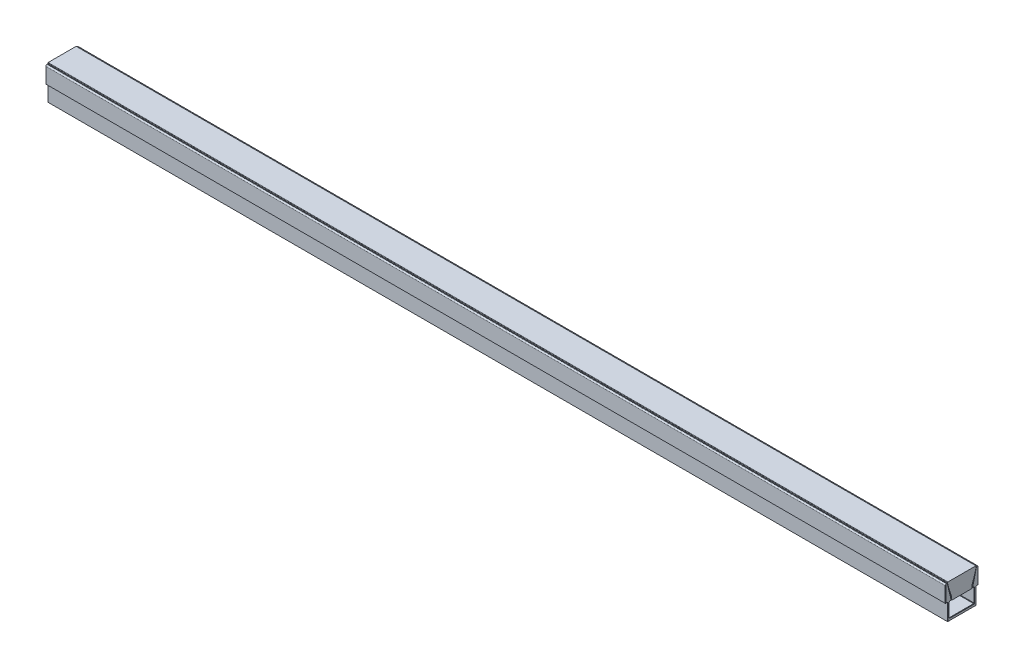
ISO-10303-21;
HEADER;
FILE_DESCRIPTION(('STEP AP214'),'2;1');
FILE_NAME('part.step','',(''),(''),'','','');
FILE_SCHEMA(('AUTOMOTIVE_DESIGN { 1 0 10303 214 1 1 1 1 }'));
ENDSEC;
DATA;
#1=APPLICATION_CONTEXT('core data for automotive mechanical design processes');
#2=APPLICATION_PROTOCOL_DEFINITION('international standard','automotive_design',2000,#1);
#3=PRODUCT_CONTEXT('',#1,'mechanical');
#4=PRODUCT('Part','Part','',(#3));
#5=PRODUCT_RELATED_PRODUCT_CATEGORY('part','',(#4));
#6=PRODUCT_DEFINITION_FORMATION('','',#4);
#7=PRODUCT_DEFINITION_CONTEXT('part definition',#1,'design');
#8=PRODUCT_DEFINITION('design','',#6,#7);
#9=PRODUCT_DEFINITION_SHAPE('','',#8);
#10=(LENGTH_UNIT() NAMED_UNIT(*) SI_UNIT(.MILLI.,.METRE.));
#11=(NAMED_UNIT(*) PLANE_ANGLE_UNIT() SI_UNIT($,.RADIAN.));
#12=(NAMED_UNIT(*) SI_UNIT($,.STERADIAN.) SOLID_ANGLE_UNIT());
#13=UNCERTAINTY_MEASURE_WITH_UNIT(LENGTH_MEASURE(1.E-05),#10,'distance_accuracy_value','');
#14=(GEOMETRIC_REPRESENTATION_CONTEXT(3) GLOBAL_UNCERTAINTY_ASSIGNED_CONTEXT((#13)) GLOBAL_UNIT_ASSIGNED_CONTEXT((#10,
#11,#12)) REPRESENTATION_CONTEXT('',''));
#15=CARTESIAN_POINT('',(0.,0.,0.));
#16=DIRECTION('',(0.,0.,1.));
#17=DIRECTION('',(1.,0.,0.));
#18=AXIS2_PLACEMENT_3D('',#15,#16,#17);
#19=CARTESIAN_POINT('',(254.,19.55,0.));
#20=DIRECTION('',(1.,0.,0.));
#21=DIRECTION('',(0.,0.,-1.));
#22=AXIS2_PLACEMENT_3D('',#19,#20,#21);
#23=PLANE('',#22);
#24=DIRECTION('',(0.,1.,0.));
#25=VECTOR('',#24,1.);
#26=CARTESIAN_POINT('',(254.,9.55,-5.84));
#27=LINE('',#26,#25);
#28=CARTESIAN_POINT('',(254.,9.55,-5.84));
#29=VERTEX_POINT('',#28);
#30=CARTESIAN_POINT('',(254.,11.55,-5.84));
#31=VERTEX_POINT('',#30);
#32=EDGE_CURVE('P0_E94',#29,#31,#27,.T.);
#33=ORIENTED_EDGE('',*,*,#32,.T.);
#34=CARTESIAN_POINT('',(254.,34.3772325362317,56.6486044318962));
#35=DIRECTION('',(1.,0.,0.));
#36=DIRECTION('',(0.,0.,1.));
#37=AXIS2_PLACEMENT_3D('',#34,#35,#36);
#38=CIRCLE('',#37,66.5274997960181);
#39=CARTESIAN_POINT('',(254.,19.05,-8.08920655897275));
#40=VERTEX_POINT('',#39);
#41=EDGE_CURVE('P0_E105',#31,#40,#38,.T.);
#42=ORIENTED_EDGE('',*,*,#41,.T.);
#43=DIRECTION('',(0.,-1.,0.));
#44=VECTOR('',#43,1.);
#45=CARTESIAN_POINT('',(254.,19.55,-8.08920655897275));
#46=LINE('',#45,#44);
#47=CARTESIAN_POINT('',(254.,19.35,-8.08920655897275));
#48=VERTEX_POINT('',#47);
#49=EDGE_CURVE('P0_E128',#48,#40,#46,.T.);
#50=ORIENTED_EDGE('',*,*,#49,.F.);
#51=CARTESIAN_POINT('',(254.,19.35,-7.88920655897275));
#52=DIRECTION('',(1.,0.,0.));
#53=DIRECTION('',(0.,0.,-1.));
#54=AXIS2_PLACEMENT_3D('',#51,#52,#53);
#55=CIRCLE('',#54,0.2);
#56=CARTESIAN_POINT('',(254.,19.55,-7.88920655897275));
#57=VERTEX_POINT('',#56);
#58=EDGE_CURVE('P0_E153',#48,#57,#55,.T.);
#59=ORIENTED_EDGE('',*,*,#58,.T.);
#60=DIRECTION('',(0.,0.,1.));
#61=VECTOR('',#60,1.);
#62=CARTESIAN_POINT('',(254.,19.55,0.));
#63=LINE('',#62,#61);
#64=CARTESIAN_POINT('',(254.,19.55,7.88920655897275));
#65=VERTEX_POINT('',#64);
#66=EDGE_CURVE('P0_E132',#57,#65,#63,.T.);
#67=ORIENTED_EDGE('',*,*,#66,.T.);
#68=CARTESIAN_POINT('',(254.,19.35,7.88920655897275));
#69=DIRECTION('',(1.,0.,0.));
#70=DIRECTION('',(0.,0.,-1.));
#71=AXIS2_PLACEMENT_3D('',#68,#69,#70);
#72=CIRCLE('',#71,0.2);
#73=CARTESIAN_POINT('',(254.,19.35,8.08920655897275));
#74=VERTEX_POINT('',#73);
#75=EDGE_CURVE('P0_E24',#65,#74,#72,.T.);
#76=ORIENTED_EDGE('',*,*,#75,.T.);
#77=DIRECTION('',(0.,-1.,0.));
#78=VECTOR('',#77,1.);
#79=CARTESIAN_POINT('',(254.,19.55,8.08920655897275));
#80=LINE('',#79,#78);
#81=CARTESIAN_POINT('',(254.,19.05,8.08920655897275));
#82=VERTEX_POINT('',#81);
#83=EDGE_CURVE('P0_E116',#74,#82,#80,.T.);
#84=ORIENTED_EDGE('',*,*,#83,.T.);
#85=CARTESIAN_POINT('',(254.,34.3772325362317,-56.6486044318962));
#86=DIRECTION('',(-1.,0.,0.));
#87=DIRECTION('',(0.,0.,-1.));
#88=AXIS2_PLACEMENT_3D('',#85,#86,#87);
#89=CIRCLE('',#88,66.5274997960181);
#90=CARTESIAN_POINT('',(254.,11.55,5.84));
#91=VERTEX_POINT('',#90);
#92=EDGE_CURVE('P0_E182',#91,#82,#89,.T.);
#93=ORIENTED_EDGE('',*,*,#92,.F.);
#94=DIRECTION('',(0.,1.,0.));
#95=VECTOR('',#94,1.);
#96=CARTESIAN_POINT('',(254.,9.55,5.84));
#97=LINE('',#96,#95);
#98=CARTESIAN_POINT('',(254.,9.55,5.84));
#99=VERTEX_POINT('',#98);
#100=EDGE_CURVE('P0_E112',#99,#91,#97,.T.);
#101=ORIENTED_EDGE('',*,*,#100,.F.);
#102=DIRECTION('',(0.,0.,-1.));
#103=VECTOR('',#102,1.);
#104=CARTESIAN_POINT('',(254.,9.55,5.84));
#105=LINE('',#104,#103);
#106=EDGE_CURVE('P0_E109',#99,#29,#105,.T.);
#107=ORIENTED_EDGE('',*,*,#106,.T.);
#108=EDGE_LOOP('',(#33,#42,#50,#59,#67,#76,#84,#93,#101,#107));
#109=FACE_BOUND('',#108,.T.);
#110=ADVANCED_FACE('P0_F16',(#109),#23,.T.);
#111=CARTESIAN_POINT('',(-254.,19.55,0.));
#112=DIRECTION('',(1.,0.,0.));
#113=DIRECTION('',(0.,0.,-1.));
#114=AXIS2_PLACEMENT_3D('',#111,#112,#113);
#115=PLANE('',#114);
#116=CARTESIAN_POINT('',(-254.,34.3772325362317,56.6486044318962));
#117=DIRECTION('',(1.,0.,0.));
#118=DIRECTION('',(0.,0.,-1.));
#119=AXIS2_PLACEMENT_3D('',#116,#117,#118);
#120=CIRCLE('',#119,66.5274997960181);
#121=CARTESIAN_POINT('',(-254.,19.05,-8.08920655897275));
#122=VERTEX_POINT('',#121);
#123=CARTESIAN_POINT('',(-254.,11.55,-5.84000000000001));
#124=VERTEX_POINT('',#123);
#125=EDGE_CURVE('P0_E188',#122,#124,#120,.F.);
#126=ORIENTED_EDGE('',*,*,#125,.T.);
#127=DIRECTION('',(0.,-1.,0.));
#128=VECTOR('',#127,1.);
#129=CARTESIAN_POINT('',(-254.,9.55,-5.84));
#130=LINE('',#129,#128);
#131=CARTESIAN_POINT('',(-254.,9.55,-5.84));
#132=VERTEX_POINT('',#131);
#133=EDGE_CURVE('P0_E185',#124,#132,#130,.T.);
#134=ORIENTED_EDGE('',*,*,#133,.T.);
#135=DIRECTION('',(0.,0.,-1.));
#136=VECTOR('',#135,1.);
#137=CARTESIAN_POINT('',(-254.,9.55,5.84));
#138=LINE('',#137,#136);
#139=CARTESIAN_POINT('',(-254.,9.55,5.84));
#140=VERTEX_POINT('',#139);
#141=EDGE_CURVE('P0_E121',#140,#132,#138,.T.);
#142=ORIENTED_EDGE('',*,*,#141,.F.);
#143=DIRECTION('',(0.,-1.,0.));
#144=VECTOR('',#143,1.);
#145=CARTESIAN_POINT('',(-254.,9.55,5.84));
#146=LINE('',#145,#144);
#147=CARTESIAN_POINT('',(-254.,11.55,5.84000000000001));
#148=VERTEX_POINT('',#147);
#149=EDGE_CURVE('P0_E177',#148,#140,#146,.T.);
#150=ORIENTED_EDGE('',*,*,#149,.F.);
#151=CARTESIAN_POINT('',(-254.,34.3772325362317,-56.6486044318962));
#152=DIRECTION('',(1.,0.,0.));
#153=DIRECTION('',(0.,0.,-1.));
#154=AXIS2_PLACEMENT_3D('',#151,#152,#153);
#155=CIRCLE('',#154,66.5274997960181);
#156=CARTESIAN_POINT('',(-254.,19.05,8.08920655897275));
#157=VERTEX_POINT('',#156);
#158=EDGE_CURVE('P0_E175',#157,#148,#155,.T.);
#159=ORIENTED_EDGE('',*,*,#158,.F.);
#160=DIRECTION('',(0.,-1.,0.));
#161=VECTOR('',#160,1.);
#162=CARTESIAN_POINT('',(-254.,19.55,8.08920655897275));
#163=LINE('',#162,#161);
#164=CARTESIAN_POINT('',(-254.,19.35,8.08920655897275));
#165=VERTEX_POINT('',#164);
#166=EDGE_CURVE('P0_E125',#165,#157,#163,.T.);
#167=ORIENTED_EDGE('',*,*,#166,.F.);
#168=CARTESIAN_POINT('',(-254.,19.35,7.88920655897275));
#169=DIRECTION('',(1.,0.,0.));
#170=DIRECTION('',(0.,0.,-1.));
#171=AXIS2_PLACEMENT_3D('',#168,#169,#170);
#172=CIRCLE('',#171,0.2);
#173=CARTESIAN_POINT('',(-254.,19.55,7.88920655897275));
#174=VERTEX_POINT('',#173);
#175=EDGE_CURVE('P0_E147',#165,#174,#172,.F.);
#176=ORIENTED_EDGE('',*,*,#175,.T.);
#177=DIRECTION('',(0.,0.,1.));
#178=VECTOR('',#177,1.);
#179=CARTESIAN_POINT('',(-254.,19.55,0.));
#180=LINE('',#179,#178);
#181=CARTESIAN_POINT('',(-254.,19.55,-7.88920655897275));
#182=VERTEX_POINT('',#181);
#183=EDGE_CURVE('P0_E122',#182,#174,#180,.T.);
#184=ORIENTED_EDGE('',*,*,#183,.F.);
#185=CARTESIAN_POINT('',(-254.,19.35,-7.88920655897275));
#186=DIRECTION('',(1.,0.,0.));
#187=DIRECTION('',(0.,0.,-1.));
#188=AXIS2_PLACEMENT_3D('',#185,#186,#187);
#189=CIRCLE('',#188,0.2);
#190=CARTESIAN_POINT('',(-254.,19.35,-8.08920655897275));
#191=VERTEX_POINT('',#190);
#192=EDGE_CURVE('P0_E145',#182,#191,#189,.F.);
#193=ORIENTED_EDGE('',*,*,#192,.T.);
#194=DIRECTION('',(0.,-1.,0.));
#195=VECTOR('',#194,1.);
#196=CARTESIAN_POINT('',(-254.,19.55,-8.08920655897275));
#197=LINE('',#196,#195);
#198=EDGE_CURVE('P0_E173',#191,#122,#197,.T.);
#199=ORIENTED_EDGE('',*,*,#198,.T.);
#200=EDGE_LOOP('',(#126,#134,#142,#150,#159,#167,#176,#184,#193,#199));
#201=FACE_BOUND('',#200,.T.);
#202=ADVANCED_FACE('P0_F166',(#201),#115,.F.);
#203=CARTESIAN_POINT('',(254.,19.55,0.));
#204=DIRECTION('',(0.,-1.,0.));
#205=DIRECTION('',(0.,0.,-1.));
#206=AXIS2_PLACEMENT_3D('',#203,#204,#205);
#207=PLANE('',#206);
#208=ORIENTED_EDGE('',*,*,#183,.T.);
#209=DIRECTION('',(-1.,0.,0.));
#210=VECTOR('',#209,1.);
#211=CARTESIAN_POINT('',(254.,19.55,7.88920655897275));
#212=LINE('',#211,#210);
#213=EDGE_CURVE('P0_E37',#174,#65,#212,.F.);
#214=ORIENTED_EDGE('',*,*,#213,.T.);
#215=ORIENTED_EDGE('',*,*,#66,.F.);
#216=DIRECTION('',(-1.,0.,0.));
#217=VECTOR('',#216,1.);
#218=CARTESIAN_POINT('',(-254.,19.55,-7.88920655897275));
#219=LINE('',#218,#217);
#220=EDGE_CURVE('P0_E149',#57,#182,#219,.T.);
#221=ORIENTED_EDGE('',*,*,#220,.T.);
#222=EDGE_LOOP('',(#208,#214,#215,#221));
#223=FACE_BOUND('',#222,.T.);
#224=ADVANCED_FACE('P0_F168',(#223),#207,.F.);
#225=CARTESIAN_POINT('',(254.,19.55,8.08920655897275));
#226=DIRECTION('',(0.,0.,-1.));
#227=DIRECTION('',(0.,1.,0.));
#228=AXIS2_PLACEMENT_3D('',#225,#226,#227);
#229=PLANE('',#228);
#230=ORIENTED_EDGE('',*,*,#83,.F.);
#231=DIRECTION('',(-1.,0.,0.));
#232=VECTOR('',#231,1.);
#233=CARTESIAN_POINT('',(254.,19.35,8.08920655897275));
#234=LINE('',#233,#232);
#235=EDGE_CURVE('P0_E142',#74,#165,#234,.T.);
#236=ORIENTED_EDGE('',*,*,#235,.T.);
#237=ORIENTED_EDGE('',*,*,#166,.T.);
#238=DIRECTION('',(-1.,0.,0.));
#239=VECTOR('',#238,1.);
#240=CARTESIAN_POINT('',(254.,19.05,8.08920655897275));
#241=LINE('',#240,#239);
#242=EDGE_CURVE('P0_E140',#82,#157,#241,.T.);
#243=ORIENTED_EDGE('',*,*,#242,.F.);
#244=EDGE_LOOP('',(#230,#236,#237,#243));
#245=FACE_BOUND('',#244,.T.);
#246=ADVANCED_FACE('P0_F160',(#245),#229,.F.);
#247=CARTESIAN_POINT('',(254.,9.55,5.84));
#248=DIRECTION('',(0.,1.,0.));
#249=DIRECTION('',(0.,0.,1.));
#250=AXIS2_PLACEMENT_3D('',#247,#248,#249);
#251=PLANE('',#250);
#252=ORIENTED_EDGE('',*,*,#141,.T.);
#253=DIRECTION('',(-1.,0.,0.));
#254=VECTOR('',#253,1.);
#255=CARTESIAN_POINT('',(254.,9.55,-5.84));
#256=LINE('',#255,#254);
#257=EDGE_CURVE('P0_E98',#29,#132,#256,.T.);
#258=ORIENTED_EDGE('',*,*,#257,.F.);
#259=ORIENTED_EDGE('',*,*,#106,.F.);
#260=DIRECTION('',(-1.,0.,0.));
#261=VECTOR('',#260,1.);
#262=CARTESIAN_POINT('',(254.,9.55,5.84));
#263=LINE('',#262,#261);
#264=EDGE_CURVE('P0_E115',#99,#140,#263,.T.);
#265=ORIENTED_EDGE('',*,*,#264,.T.);
#266=EDGE_LOOP('',(#252,#258,#259,#265));
#267=FACE_BOUND('',#266,.T.);
#268=ADVANCED_FACE('P0_F119',(#267),#251,.F.);
#269=CARTESIAN_POINT('',(254.,19.55,-8.08920655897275));
#270=DIRECTION('',(0.,0.,-1.));
#271=DIRECTION('',(0.,1.,0.));
#272=AXIS2_PLACEMENT_3D('',#269,#270,#271);
#273=PLANE('',#272);
#274=ORIENTED_EDGE('',*,*,#198,.F.);
#275=DIRECTION('',(-1.,0.,0.));
#276=VECTOR('',#275,1.);
#277=CARTESIAN_POINT('',(254.,19.35,-8.08920655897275));
#278=LINE('',#277,#276);
#279=EDGE_CURVE('P0_E11',#191,#48,#278,.F.);
#280=ORIENTED_EDGE('',*,*,#279,.T.);
#281=ORIENTED_EDGE('',*,*,#49,.T.);
#282=DIRECTION('',(-1.,0.,0.));
#283=VECTOR('',#282,1.);
#284=CARTESIAN_POINT('',(254.,19.05,-8.08920655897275));
#285=LINE('',#284,#283);
#286=EDGE_CURVE('P0_E123',#40,#122,#285,.T.);
#287=ORIENTED_EDGE('',*,*,#286,.T.);
#288=EDGE_LOOP('',(#274,#280,#281,#287));
#289=FACE_BOUND('',#288,.T.);
#290=ADVANCED_FACE('P0_F174',(#289),#273,.T.);
#291=CARTESIAN_POINT('',(254.,19.35,7.88920655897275));
#292=DIRECTION('',(-1.,0.,0.));
#293=DIRECTION('',(0.,0.,1.));
#294=AXIS2_PLACEMENT_3D('',#291,#292,#293);
#295=CYLINDRICAL_SURFACE('',#294,0.2);
#296=ORIENTED_EDGE('',*,*,#75,.F.);
#297=ORIENTED_EDGE('',*,*,#213,.F.);
#298=ORIENTED_EDGE('',*,*,#175,.F.);
#299=ORIENTED_EDGE('',*,*,#235,.F.);
#300=EDGE_LOOP('',(#296,#297,#298,#299));
#301=FACE_BOUND('',#300,.T.);
#302=ADVANCED_FACE('P0_F162',(#301),#295,.T.);
#303=CARTESIAN_POINT('',(254.,19.35,-7.88920655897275));
#304=DIRECTION('',(1.,0.,0.));
#305=DIRECTION('',(0.,0.,-1.));
#306=AXIS2_PLACEMENT_3D('',#303,#304,#305);
#307=CYLINDRICAL_SURFACE('',#306,0.2);
#308=ORIENTED_EDGE('',*,*,#58,.F.);
#309=ORIENTED_EDGE('',*,*,#279,.F.);
#310=ORIENTED_EDGE('',*,*,#192,.F.);
#311=ORIENTED_EDGE('',*,*,#220,.F.);
#312=EDGE_LOOP('',(#308,#309,#310,#311));
#313=FACE_BOUND('',#312,.T.);
#314=ADVANCED_FACE('P0_F18',(#313),#307,.T.);
#315=CARTESIAN_POINT('',(-263.762629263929,9.55,5.84));
#316=DIRECTION('',(0.,0.,-1.));
#317=DIRECTION('',(0.,1.,0.));
#318=AXIS2_PLACEMENT_3D('',#315,#316,#317);
#319=PLANE('',#318);
#320=ORIENTED_EDGE('',*,*,#149,.T.);
#321=ORIENTED_EDGE('',*,*,#264,.F.);
#322=ORIENTED_EDGE('',*,*,#100,.T.);
#323=DIRECTION('',(1.,0.,0.));
#324=VECTOR('',#323,1.);
#325=CARTESIAN_POINT('',(-263.762629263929,11.55,5.84));
#326=LINE('',#325,#324);
#327=EDGE_CURVE('P0_E180',#148,#91,#326,.T.);
#328=ORIENTED_EDGE('',*,*,#327,.F.);
#329=EDGE_LOOP('',(#320,#321,#322,#328));
#330=FACE_BOUND('',#329,.T.);
#331=ADVANCED_FACE('P0_F202',(#330),#319,.F.);
#332=CARTESIAN_POINT('',(-263.762629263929,34.3772325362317,-56.6486044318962));
#333=DIRECTION('',(1.,0.,0.));
#334=DIRECTION('',(0.,0.,-1.));
#335=AXIS2_PLACEMENT_3D('',#332,#333,#334);
#336=CYLINDRICAL_SURFACE('',#335,66.5274997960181);
#337=ORIENTED_EDGE('',*,*,#158,.T.);
#338=ORIENTED_EDGE('',*,*,#327,.T.);
#339=ORIENTED_EDGE('',*,*,#92,.T.);
#340=ORIENTED_EDGE('',*,*,#242,.T.);
#341=EDGE_LOOP('',(#337,#338,#339,#340));
#342=FACE_BOUND('',#341,.T.);
#343=ADVANCED_FACE('P0_F194',(#342),#336,.T.);
#344=CARTESIAN_POINT('',(-263.762629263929,34.3772325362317,56.6486044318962));
#345=DIRECTION('',(1.,0.,0.));
#346=DIRECTION('',(0.,0.,-1.));
#347=AXIS2_PLACEMENT_3D('',#344,#345,#346);
#348=CYLINDRICAL_SURFACE('',#347,66.5274997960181);
#349=ORIENTED_EDGE('',*,*,#286,.F.);
#350=ORIENTED_EDGE('',*,*,#41,.F.);
#351=DIRECTION('',(1.,0.,0.));
#352=VECTOR('',#351,1.);
#353=CARTESIAN_POINT('',(-263.762629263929,11.55,-5.84));
#354=LINE('',#353,#352);
#355=EDGE_CURVE('P0_E101',#124,#31,#354,.T.);
#356=ORIENTED_EDGE('',*,*,#355,.F.);
#357=ORIENTED_EDGE('',*,*,#125,.F.);
#358=EDGE_LOOP('',(#349,#350,#356,#357));
#359=FACE_BOUND('',#358,.T.);
#360=ADVANCED_FACE('P0_F192',(#359),#348,.T.);
#361=CARTESIAN_POINT('',(-263.762629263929,9.55,-5.84));
#362=DIRECTION('',(0.,0.,-1.));
#363=DIRECTION('',(0.,1.,0.));
#364=AXIS2_PLACEMENT_3D('',#361,#362,#363);
#365=PLANE('',#364);
#366=ORIENTED_EDGE('',*,*,#355,.T.);
#367=ORIENTED_EDGE('',*,*,#32,.F.);
#368=ORIENTED_EDGE('',*,*,#257,.T.);
#369=ORIENTED_EDGE('',*,*,#133,.F.);
#370=EDGE_LOOP('',(#366,#367,#368,#369));
#371=FACE_BOUND('',#370,.T.);
#372=ADVANCED_FACE('P0_F96',(#371),#365,.T.);
#373=CLOSED_SHELL('',(#110,#202,#224,#246,#268,#290,#302,#314,#331,#343,#360,#372));
#374=MANIFOLD_SOLID_BREP('P0_B1',#373);
#375=CARTESIAN_POINT('',(-254.,0.,0.));
#376=DIRECTION('',(-1.,0.,0.));
#377=DIRECTION('',(0.,0.,1.));
#378=AXIS2_PLACEMENT_3D('',#375,#376,#377);
#379=PLANE('',#378);
#380=DIRECTION('',(0.,0.,-1.));
#381=VECTOR('',#380,1.);
#382=CARTESIAN_POINT('',(-254.,19.05,-9.3));
#383=LINE('',#382,#381);
#384=CARTESIAN_POINT('',(-254.,19.05,-8.56403451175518));
#385=VERTEX_POINT('',#384);
#386=CARTESIAN_POINT('',(-254.,19.05,-8.65));
#387=VERTEX_POINT('',#386);
#388=EDGE_CURVE('P1_E720',#385,#387,#383,.T.);
#389=ORIENTED_EDGE('',*,*,#388,.T.);
#390=CARTESIAN_POINT('',(-254.,18.4,-8.65));
#391=DIRECTION('',(-1.,0.,0.));
#392=DIRECTION('',(0.,0.,1.));
#393=AXIS2_PLACEMENT_3D('',#390,#391,#392);
#394=CIRCLE('',#393,0.65);
#395=CARTESIAN_POINT('',(-254.,18.8690415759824,-9.10000000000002));
#396=VERTEX_POINT('',#395);
#397=EDGE_CURVE('P1_E829',#387,#396,#394,.T.);
#398=ORIENTED_EDGE('',*,*,#397,.T.);
#399=DIRECTION('',(0.,-1.,0.));
#400=VECTOR('',#399,1.);
#401=CARTESIAN_POINT('',(-254.,0.,-9.10000000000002));
#402=LINE('',#401,#400);
#403=CARTESIAN_POINT('',(-254.,9.74999999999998,-9.10000000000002));
#404=VERTEX_POINT('',#403);
#405=EDGE_CURVE('P1_E496',#396,#404,#402,.T.);
#406=ORIENTED_EDGE('',*,*,#405,.T.);
#407=DIRECTION('',(0.,0.,1.));
#408=VECTOR('',#407,1.);
#409=CARTESIAN_POINT('',(-254.,9.74999999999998,0.));
#410=LINE('',#409,#408);
#411=CARTESIAN_POINT('',(-254.,9.74999999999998,-8.24999999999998));
#412=VERTEX_POINT('',#411);
#413=EDGE_CURVE('P1_E494',#404,#412,#410,.T.);
#414=ORIENTED_EDGE('',*,*,#413,.T.);
#415=DIRECTION('',(0.,0.707106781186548,-0.707106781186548));
#416=VECTOR('',#415,1.);
#417=CARTESIAN_POINT('',(-254.,0.749999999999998,0.749999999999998));
#418=LINE('',#417,#416);
#419=CARTESIAN_POINT('',(-254.,9.55,-8.05));
#420=VERTEX_POINT('',#419);
#421=EDGE_CURVE('P1_E491',#420,#412,#418,.T.);
#422=ORIENTED_EDGE('',*,*,#421,.F.);
#423=DIRECTION('',(0.,0.707106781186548,-0.707106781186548));
#424=VECTOR('',#423,1.);
#425=CARTESIAN_POINT('',(-254.,0.749999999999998,0.749999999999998));
#426=LINE('',#425,#424);
#427=CARTESIAN_POINT('',(-254.,9.35000000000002,-7.85000000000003));
#428=VERTEX_POINT('',#427);
#429=EDGE_CURVE('P1_E488',#428,#420,#426,.T.);
#430=ORIENTED_EDGE('',*,*,#429,.F.);
#431=DIRECTION('',(0.,-1.,0.));
#432=VECTOR('',#431,1.);
#433=CARTESIAN_POINT('',(-254.,0.,-7.85000000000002));
#434=LINE('',#433,#432);
#435=CARTESIAN_POINT('',(-254.,0.199999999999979,-7.85000000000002));
#436=VERTEX_POINT('',#435);
#437=EDGE_CURVE('P1_E486',#428,#436,#434,.T.);
#438=ORIENTED_EDGE('',*,*,#437,.T.);
#439=DIRECTION('',(0.,0.,1.));
#440=VECTOR('',#439,1.);
#441=CARTESIAN_POINT('',(-254.,0.199999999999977,8.05));
#442=LINE('',#441,#440);
#443=CARTESIAN_POINT('',(-254.,0.199999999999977,7.85000000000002));
#444=VERTEX_POINT('',#443);
#445=EDGE_CURVE('P1_E484',#436,#444,#442,.T.);
#446=ORIENTED_EDGE('',*,*,#445,.T.);
#447=DIRECTION('',(0.,1.,0.));
#448=VECTOR('',#447,1.);
#449=CARTESIAN_POINT('',(-254.,9.55,7.85000000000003));
#450=LINE('',#449,#448);
#451=CARTESIAN_POINT('',(-254.,9.35000000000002,7.85000000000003));
#452=VERTEX_POINT('',#451);
#453=EDGE_CURVE('P1_E482',#444,#452,#450,.T.);
#454=ORIENTED_EDGE('',*,*,#453,.T.);
#455=DIRECTION('',(0.,-0.707106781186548,-0.707106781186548));
#456=VECTOR('',#455,1.);
#457=CARTESIAN_POINT('',(-254.,0.749999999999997,-0.749999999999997));
#458=LINE('',#457,#456);
#459=CARTESIAN_POINT('',(-254.,9.55,8.05));
#460=VERTEX_POINT('',#459);
#461=EDGE_CURVE('P1_E479',#460,#452,#458,.T.);
#462=ORIENTED_EDGE('',*,*,#461,.F.);
#463=DIRECTION('',(0.,-0.707106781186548,-0.707106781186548));
#464=VECTOR('',#463,1.);
#465=CARTESIAN_POINT('',(-254.,0.749999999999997,-0.749999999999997));
#466=LINE('',#465,#464);
#467=CARTESIAN_POINT('',(-254.,9.74999999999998,8.24999999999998));
#468=VERTEX_POINT('',#467);
#469=EDGE_CURVE('P1_E476',#468,#460,#466,.T.);
#470=ORIENTED_EDGE('',*,*,#469,.F.);
#471=DIRECTION('',(0.,0.,1.));
#472=VECTOR('',#471,1.);
#473=CARTESIAN_POINT('',(-254.,9.74999999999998,9.3));
#474=LINE('',#473,#472);
#475=CARTESIAN_POINT('',(-254.,9.74999999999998,9.10000000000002));
#476=VERTEX_POINT('',#475);
#477=EDGE_CURVE('P1_E474',#468,#476,#474,.T.);
#478=ORIENTED_EDGE('',*,*,#477,.T.);
#479=DIRECTION('',(0.,1.,0.));
#480=VECTOR('',#479,1.);
#481=CARTESIAN_POINT('',(-254.,19.05,9.10000000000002));
#482=LINE('',#481,#480);
#483=CARTESIAN_POINT('',(-254.,18.8690415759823,9.10000000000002));
#484=VERTEX_POINT('',#483);
#485=EDGE_CURVE('P1_E471',#476,#484,#482,.T.);
#486=ORIENTED_EDGE('',*,*,#485,.T.);
#487=CARTESIAN_POINT('',(-254.,18.4,8.65));
#488=DIRECTION('',(-1.,0.,0.));
#489=DIRECTION('',(0.,0.,1.));
#490=AXIS2_PLACEMENT_3D('',#487,#488,#489);
#491=CIRCLE('',#490,0.65);
#492=CARTESIAN_POINT('',(-254.,19.05,8.65));
#493=VERTEX_POINT('',#492);
#494=EDGE_CURVE('P1_E825',#484,#493,#491,.T.);
#495=ORIENTED_EDGE('',*,*,#494,.T.);
#496=DIRECTION('',(0.,0.,1.));
#497=VECTOR('',#496,1.);
#498=CARTESIAN_POINT('',(-254.,19.05,9.3));
#499=LINE('',#498,#497);
#500=CARTESIAN_POINT('',(-254.,19.05,8.56403451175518));
#501=VERTEX_POINT('',#500);
#502=EDGE_CURVE('P1_E1033',#501,#493,#499,.T.);
#503=ORIENTED_EDGE('',*,*,#502,.F.);
#504=CARTESIAN_POINT('',(-254.,18.4,8.56403451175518));
#505=DIRECTION('',(-1.,0.,0.));
#506=DIRECTION('',(0.,0.,1.));
#507=AXIS2_PLACEMENT_3D('',#504,#505,#506);
#508=CIRCLE('',#507,0.65);
#509=CARTESIAN_POINT('',(-254.,18.9601249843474,8.23424669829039));
#510=VERTEX_POINT('',#509);
#511=EDGE_CURVE('P1_E823',#501,#510,#508,.T.);
#512=ORIENTED_EDGE('',*,*,#511,.T.);
#513=DIRECTION('',(0.,-0.97308028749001,-0.230466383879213));
#514=VECTOR('',#513,1.);
#515=CARTESIAN_POINT('',(-254.,9.50390672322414,5.99461605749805));
#516=LINE('',#515,#514);
#517=CARTESIAN_POINT('',(-254.,9.75000000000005,6.05290130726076));
#518=VERTEX_POINT('',#517);
#519=EDGE_CURVE('P1_E498',#510,#518,#516,.T.);
#520=ORIENTED_EDGE('',*,*,#519,.T.);
#521=DIRECTION('',(0.,0.,1.));
#522=VECTOR('',#521,1.);
#523=CARTESIAN_POINT('',(-254.,9.75000000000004,7.05));
#524=LINE('',#523,#522);
#525=CARTESIAN_POINT('',(-254.,9.75000000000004,6.84999999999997));
#526=VERTEX_POINT('',#525);
#527=EDGE_CURVE('P1_E500',#518,#526,#524,.T.);
#528=ORIENTED_EDGE('',*,*,#527,.T.);
#529=DIRECTION('',(0.,0.707106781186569,-0.707106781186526));
#530=VECTOR('',#529,1.);
#531=CARTESIAN_POINT('',(-254.,8.29999999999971,8.30000000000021));
#532=LINE('',#531,#530);
#533=CARTESIAN_POINT('',(-254.,9.55,7.05));
#534=VERTEX_POINT('',#533);
#535=EDGE_CURVE('P1_E502',#534,#526,#532,.T.);
#536=ORIENTED_EDGE('',*,*,#535,.F.);
#537=DIRECTION('',(0.,0.707106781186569,-0.707106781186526));
#538=VECTOR('',#537,1.);
#539=CARTESIAN_POINT('',(-254.,8.29999999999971,8.30000000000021));
#540=LINE('',#539,#538);
#541=CARTESIAN_POINT('',(-254.,9.34999999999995,7.25000000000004));
#542=VERTEX_POINT('',#541);
#543=EDGE_CURVE('P1_E505',#542,#534,#540,.T.);
#544=ORIENTED_EDGE('',*,*,#543,.F.);
#545=DIRECTION('',(0.,-1.,0.));
#546=VECTOR('',#545,1.);
#547=CARTESIAN_POINT('',(-254.,1.5,7.25000000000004));
#548=LINE('',#547,#546);
#549=CARTESIAN_POINT('',(-254.,1.70000000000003,7.25000000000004));
#550=VERTEX_POINT('',#549);
#551=EDGE_CURVE('P1_E508',#542,#550,#548,.T.);
#552=ORIENTED_EDGE('',*,*,#551,.T.);
#553=DIRECTION('',(0.,0.707106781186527,0.707106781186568));
#554=VECTOR('',#553,1.);
#555=CARTESIAN_POINT('',(-254.,-2.77499999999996,2.77499999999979));
#556=LINE('',#555,#554);
#557=CARTESIAN_POINT('',(-254.,1.5,7.05));
#558=VERTEX_POINT('',#557);
#559=EDGE_CURVE('P1_E510',#558,#550,#556,.T.);
#560=ORIENTED_EDGE('',*,*,#559,.F.);
#561=DIRECTION('',(0.,0.707106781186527,0.707106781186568));
#562=VECTOR('',#561,1.);
#563=CARTESIAN_POINT('',(-254.,-2.77499999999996,2.77499999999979));
#564=LINE('',#563,#562);
#565=CARTESIAN_POINT('',(-254.,1.29999999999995,6.84999999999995));
#566=VERTEX_POINT('',#565);
#567=EDGE_CURVE('P1_E513',#566,#558,#564,.T.);
#568=ORIENTED_EDGE('',*,*,#567,.F.);
#569=DIRECTION('',(0.,0.,-1.));
#570=VECTOR('',#569,1.);
#571=CARTESIAN_POINT('',(-254.,1.29999999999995,-7.05));
#572=LINE('',#571,#570);
#573=CARTESIAN_POINT('',(-254.,1.29999999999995,-6.84999999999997));
#574=VERTEX_POINT('',#573);
#575=EDGE_CURVE('P1_E516',#566,#574,#572,.T.);
#576=ORIENTED_EDGE('',*,*,#575,.T.);
#577=DIRECTION('',(0.,-0.707106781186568,0.707106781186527));
#578=VECTOR('',#577,1.);
#579=CARTESIAN_POINT('',(-254.,-2.77500000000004,-2.77500000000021));
#580=LINE('',#579,#578);
#581=CARTESIAN_POINT('',(-254.,1.5,-7.05));
#582=VERTEX_POINT('',#581);
#583=EDGE_CURVE('P1_E518',#582,#574,#580,.T.);
#584=ORIENTED_EDGE('',*,*,#583,.F.);
#585=DIRECTION('',(0.,-0.707106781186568,0.707106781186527));
#586=VECTOR('',#585,1.);
#587=CARTESIAN_POINT('',(-254.,-2.77500000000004,-2.77500000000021));
#588=LINE('',#587,#586);
#589=CARTESIAN_POINT('',(-254.,1.70000000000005,-7.25000000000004));
#590=VERTEX_POINT('',#589);
#591=EDGE_CURVE('P1_E521',#590,#582,#588,.T.);
#592=ORIENTED_EDGE('',*,*,#591,.F.);
#593=DIRECTION('',(0.,1.,0.));
#594=VECTOR('',#593,1.);
#595=CARTESIAN_POINT('',(-254.,0.,-7.25000000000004));
#596=LINE('',#595,#594);
#597=CARTESIAN_POINT('',(-254.,9.34999999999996,-7.25000000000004));
#598=VERTEX_POINT('',#597);
#599=EDGE_CURVE('P1_E524',#590,#598,#596,.T.);
#600=ORIENTED_EDGE('',*,*,#599,.T.);
#601=DIRECTION('',(0.,-0.707106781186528,-0.707106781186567));
#602=VECTOR('',#601,1.);
#603=CARTESIAN_POINT('',(-254.,8.30000000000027,-8.2999999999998));
#604=LINE('',#603,#602);
#605=CARTESIAN_POINT('',(-254.,9.55,-7.05));
#606=VERTEX_POINT('',#605);
#607=EDGE_CURVE('P1_E526',#606,#598,#604,.T.);
#608=ORIENTED_EDGE('',*,*,#607,.F.);
#609=DIRECTION('',(0.,-0.707106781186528,-0.707106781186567));
#610=VECTOR('',#609,1.);
#611=CARTESIAN_POINT('',(-254.,8.30000000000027,-8.2999999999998));
#612=LINE('',#611,#610);
#613=CARTESIAN_POINT('',(-254.,9.75000000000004,-6.84999999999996));
#614=VERTEX_POINT('',#613);
#615=EDGE_CURVE('P1_E529',#614,#606,#612,.T.);
#616=ORIENTED_EDGE('',*,*,#615,.F.);
#617=DIRECTION('',(0.,0.,1.));
#618=VECTOR('',#617,1.);
#619=CARTESIAN_POINT('',(-254.,9.75000000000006,0.));
#620=LINE('',#619,#618);
#621=CARTESIAN_POINT('',(-254.,9.75000000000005,-6.05290130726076));
#622=VERTEX_POINT('',#621);
#623=EDGE_CURVE('P1_E532',#614,#622,#620,.T.);
#624=ORIENTED_EDGE('',*,*,#623,.T.);
#625=DIRECTION('',(0.,0.97308028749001,-0.230466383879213));
#626=VECTOR('',#625,1.);
#627=CARTESIAN_POINT('',(-254.,-0.839568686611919,-3.54484556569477));
#628=LINE('',#627,#626);
#629=CARTESIAN_POINT('',(-254.,18.9601249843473,-8.23424669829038));
#630=VERTEX_POINT('',#629);
#631=EDGE_CURVE('P1_E534',#622,#630,#628,.T.);
#632=ORIENTED_EDGE('',*,*,#631,.T.);
#633=CARTESIAN_POINT('',(-254.,18.4,-8.56403451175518));
#634=DIRECTION('',(-1.,0.,0.));
#635=DIRECTION('',(0.,0.,1.));
#636=AXIS2_PLACEMENT_3D('',#633,#634,#635);
#637=CIRCLE('',#636,0.65);
#638=EDGE_CURVE('P1_E827',#630,#385,#637,.T.);
#639=ORIENTED_EDGE('',*,*,#638,.T.);
#640=EDGE_LOOP('',(#389,#398,#406,#414,#422,#430,#438,#446,#454,#462,#470,#478,#486,#495,#503,
#512,#520,#528,#536,#544,#552,#560,#568,#576,#584,#592,#600,#608,#616,#624,#632,#639));
#641=FACE_BOUND('',#640,.T.);
#642=ADVANCED_FACE('P1_F15',(#641),#379,.T.);
#643=CARTESIAN_POINT('',(254.,0.,0.));
#644=DIRECTION('',(-1.,0.,0.));
#645=DIRECTION('',(0.,0.,1.));
#646=AXIS2_PLACEMENT_3D('',#643,#644,#645);
#647=PLANE('',#646);
#648=DIRECTION('',(0.,1.,0.));
#649=VECTOR('',#648,1.);
#650=CARTESIAN_POINT('',(254.,19.05,-9.10000000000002));
#651=LINE('',#650,#649);
#652=CARTESIAN_POINT('',(254.,9.74999999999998,-9.10000000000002));
#653=VERTEX_POINT('',#652);
#654=CARTESIAN_POINT('',(254.,18.8690415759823,-9.10000000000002));
#655=VERTEX_POINT('',#654);
#656=EDGE_CURVE('P1_E409',#653,#655,#651,.T.);
#657=ORIENTED_EDGE('',*,*,#656,.T.);
#658=CARTESIAN_POINT('',(254.,18.4,-8.65));
#659=DIRECTION('',(-1.,0.,0.));
#660=DIRECTION('',(0.,0.,1.));
#661=AXIS2_PLACEMENT_3D('',#658,#659,#660);
#662=CIRCLE('',#661,0.65);
#663=CARTESIAN_POINT('',(254.,19.05,-8.65));
#664=VERTEX_POINT('',#663);
#665=EDGE_CURVE('P1_E843',#655,#664,#662,.F.);
#666=ORIENTED_EDGE('',*,*,#665,.T.);
#667=DIRECTION('',(0.,0.,-1.));
#668=VECTOR('',#667,1.);
#669=CARTESIAN_POINT('',(254.,19.05,-9.3));
#670=LINE('',#669,#668);
#671=CARTESIAN_POINT('',(254.,19.05,-8.56403451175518));
#672=VERTEX_POINT('',#671);
#673=EDGE_CURVE('P1_E1027',#672,#664,#670,.T.);
#674=ORIENTED_EDGE('',*,*,#673,.F.);
#675=CARTESIAN_POINT('',(254.,18.4,-8.56403451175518));
#676=DIRECTION('',(-1.,0.,0.));
#677=DIRECTION('',(0.,0.,1.));
#678=AXIS2_PLACEMENT_3D('',#675,#676,#677);
#679=CIRCLE('',#678,0.65);
#680=CARTESIAN_POINT('',(254.,18.9601249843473,-8.23424669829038));
#681=VERTEX_POINT('',#680);
#682=EDGE_CURVE('P1_E841',#672,#681,#679,.F.);
#683=ORIENTED_EDGE('',*,*,#682,.T.);
#684=DIRECTION('',(0.,-0.97308028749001,0.230466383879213));
#685=VECTOR('',#684,1.);
#686=CARTESIAN_POINT('',(254.,9.50390672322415,-5.99461605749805));
#687=LINE('',#686,#685);
#688=CARTESIAN_POINT('',(254.,9.75000000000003,-6.05290130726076));
#689=VERTEX_POINT('',#688);
#690=EDGE_CURVE('P1_E440',#681,#689,#687,.T.);
#691=ORIENTED_EDGE('',*,*,#690,.T.);
#692=DIRECTION('',(0.,0.,-1.));
#693=VECTOR('',#692,1.);
#694=CARTESIAN_POINT('',(254.,9.75000000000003,-7.05));
#695=LINE('',#694,#693);
#696=CARTESIAN_POINT('',(254.,9.75000000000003,-6.84999999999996));
#697=VERTEX_POINT('',#696);
#698=EDGE_CURVE('P1_E436',#689,#697,#695,.T.);
#699=ORIENTED_EDGE('',*,*,#698,.T.);
#700=DIRECTION('',(0.,0.707106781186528,0.707106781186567));
#701=VECTOR('',#700,1.);
#702=CARTESIAN_POINT('',(254.,9.75000000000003,-6.84999999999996));
#703=LINE('',#702,#701);
#704=CARTESIAN_POINT('',(254.,9.55,-7.05));
#705=VERTEX_POINT('',#704);
#706=EDGE_CURVE('P1_E433',#705,#697,#703,.T.);
#707=ORIENTED_EDGE('',*,*,#706,.F.);
#708=DIRECTION('',(0.,0.707106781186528,0.707106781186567));
#709=VECTOR('',#708,1.);
#710=CARTESIAN_POINT('',(254.,9.75000000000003,-6.84999999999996));
#711=LINE('',#710,#709);
#712=CARTESIAN_POINT('',(254.,9.34999999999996,-7.25000000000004));
#713=VERTEX_POINT('',#712);
#714=EDGE_CURVE('P1_E424',#713,#705,#711,.T.);
#715=ORIENTED_EDGE('',*,*,#714,.F.);
#716=DIRECTION('',(0.,-1.,0.));
#717=VECTOR('',#716,1.);
#718=CARTESIAN_POINT('',(254.,1.5,-7.25000000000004));
#719=LINE('',#718,#717);
#720=CARTESIAN_POINT('',(254.,1.70000000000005,-7.25000000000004));
#721=VERTEX_POINT('',#720);
#722=EDGE_CURVE('P1_E420',#713,#721,#719,.T.);
#723=ORIENTED_EDGE('',*,*,#722,.T.);
#724=DIRECTION('',(0.,0.707106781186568,-0.707106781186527));
#725=VECTOR('',#724,1.);
#726=CARTESIAN_POINT('',(254.,1.70000000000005,-7.25000000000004));
#727=LINE('',#726,#725);
#728=CARTESIAN_POINT('',(254.,1.5,-7.05));
#729=VERTEX_POINT('',#728);
#730=EDGE_CURVE('P1_E414',#729,#721,#727,.T.);
#731=ORIENTED_EDGE('',*,*,#730,.F.);
#732=DIRECTION('',(0.,0.707106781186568,-0.707106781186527));
#733=VECTOR('',#732,1.);
#734=CARTESIAN_POINT('',(254.,1.70000000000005,-7.25000000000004));
#735=LINE('',#734,#733);
#736=CARTESIAN_POINT('',(254.,1.29999999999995,-6.84999999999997));
#737=VERTEX_POINT('',#736);
#738=EDGE_CURVE('P1_E417',#737,#729,#735,.T.);
#739=ORIENTED_EDGE('',*,*,#738,.F.);
#740=DIRECTION('',(0.,0.,1.));
#741=VECTOR('',#740,1.);
#742=CARTESIAN_POINT('',(254.,1.29999999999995,0.));
#743=LINE('',#742,#741);
#744=CARTESIAN_POINT('',(254.,1.29999999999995,6.84999999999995));
#745=VERTEX_POINT('',#744);
#746=EDGE_CURVE('P1_E422',#737,#745,#743,.T.);
#747=ORIENTED_EDGE('',*,*,#746,.T.);
#748=DIRECTION('',(0.,-0.707106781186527,-0.707106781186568));
#749=VECTOR('',#748,1.);
#750=CARTESIAN_POINT('',(254.,1.29999999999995,6.84999999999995));
#751=LINE('',#750,#749);
#752=CARTESIAN_POINT('',(254.,1.5,7.05));
#753=VERTEX_POINT('',#752);
#754=EDGE_CURVE('P1_E427',#753,#745,#751,.T.);
#755=ORIENTED_EDGE('',*,*,#754,.F.);
#756=DIRECTION('',(0.,-0.707106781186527,-0.707106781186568));
#757=VECTOR('',#756,1.);
#758=CARTESIAN_POINT('',(254.,1.29999999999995,6.84999999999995));
#759=LINE('',#758,#757);
#760=CARTESIAN_POINT('',(254.,1.70000000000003,7.25000000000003));
#761=VERTEX_POINT('',#760);
#762=EDGE_CURVE('P1_E430',#761,#753,#759,.T.);
#763=ORIENTED_EDGE('',*,*,#762,.F.);
#764=DIRECTION('',(0.,1.,0.));
#765=VECTOR('',#764,1.);
#766=CARTESIAN_POINT('',(254.,0.,7.25000000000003));
#767=LINE('',#766,#765);
#768=CARTESIAN_POINT('',(254.,9.34999999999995,7.25000000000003));
#769=VERTEX_POINT('',#768);
#770=EDGE_CURVE('P1_E438',#761,#769,#767,.T.);
#771=ORIENTED_EDGE('',*,*,#770,.T.);
#772=DIRECTION('',(0.,-0.707106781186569,0.707106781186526));
#773=VECTOR('',#772,1.);
#774=CARTESIAN_POINT('',(254.,9.34999999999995,7.25000000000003));
#775=LINE('',#774,#773);
#776=CARTESIAN_POINT('',(254.,9.55,7.05));
#777=VERTEX_POINT('',#776);
#778=EDGE_CURVE('P1_E442',#777,#769,#775,.T.);
#779=ORIENTED_EDGE('',*,*,#778,.F.);
#780=DIRECTION('',(0.,-0.707106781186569,0.707106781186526));
#781=VECTOR('',#780,1.);
#782=CARTESIAN_POINT('',(254.,9.34999999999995,7.25000000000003));
#783=LINE('',#782,#781);
#784=CARTESIAN_POINT('',(254.,9.75000000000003,6.84999999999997));
#785=VERTEX_POINT('',#784);
#786=EDGE_CURVE('P1_E445',#785,#777,#783,.T.);
#787=ORIENTED_EDGE('',*,*,#786,.F.);
#788=DIRECTION('',(0.,0.,-1.));
#789=VECTOR('',#788,1.);
#790=CARTESIAN_POINT('',(254.,9.75000000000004,0.));
#791=LINE('',#790,#789);
#792=CARTESIAN_POINT('',(254.,9.75000000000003,6.05290130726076));
#793=VERTEX_POINT('',#792);
#794=EDGE_CURVE('P1_E448',#785,#793,#791,.T.);
#795=ORIENTED_EDGE('',*,*,#794,.T.);
#796=DIRECTION('',(0.,0.97308028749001,0.230466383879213));
#797=VECTOR('',#796,1.);
#798=CARTESIAN_POINT('',(254.,-0.839568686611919,3.54484556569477));
#799=LINE('',#798,#797);
#800=CARTESIAN_POINT('',(254.,18.9601249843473,8.23424669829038));
#801=VERTEX_POINT('',#800);
#802=EDGE_CURVE('P1_E450',#793,#801,#799,.T.);
#803=ORIENTED_EDGE('',*,*,#802,.T.);
#804=CARTESIAN_POINT('',(254.,18.4,8.56403451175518));
#805=DIRECTION('',(-1.,0.,0.));
#806=DIRECTION('',(0.,0.,1.));
#807=AXIS2_PLACEMENT_3D('',#804,#805,#806);
#808=CIRCLE('',#807,0.65);
#809=CARTESIAN_POINT('',(254.,19.05,8.56403451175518));
#810=VERTEX_POINT('',#809);
#811=EDGE_CURVE('P1_E837',#801,#810,#808,.F.);
#812=ORIENTED_EDGE('',*,*,#811,.T.);
#813=DIRECTION('',(0.,0.,1.));
#814=VECTOR('',#813,1.);
#815=CARTESIAN_POINT('',(254.,19.05,9.3));
#816=LINE('',#815,#814);
#817=CARTESIAN_POINT('',(254.,19.05,8.65));
#818=VERTEX_POINT('',#817);
#819=EDGE_CURVE('P1_E1035',#810,#818,#816,.T.);
#820=ORIENTED_EDGE('',*,*,#819,.T.);
#821=CARTESIAN_POINT('',(254.,18.4,8.65));
#822=DIRECTION('',(-1.,0.,0.));
#823=DIRECTION('',(0.,0.,1.));
#824=AXIS2_PLACEMENT_3D('',#821,#822,#823);
#825=CIRCLE('',#824,0.65);
#826=CARTESIAN_POINT('',(254.,18.8690415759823,9.10000000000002));
#827=VERTEX_POINT('',#826);
#828=EDGE_CURVE('P1_E839',#818,#827,#825,.F.);
#829=ORIENTED_EDGE('',*,*,#828,.T.);
#830=DIRECTION('',(0.,-1.,0.));
#831=VECTOR('',#830,1.);
#832=CARTESIAN_POINT('',(254.,0.,9.10000000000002));
#833=LINE('',#832,#831);
#834=CARTESIAN_POINT('',(254.,9.74999999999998,9.10000000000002));
#835=VERTEX_POINT('',#834);
#836=EDGE_CURVE('P1_E871',#827,#835,#833,.T.);
#837=ORIENTED_EDGE('',*,*,#836,.T.);
#838=DIRECTION('',(0.,0.,-1.));
#839=VECTOR('',#838,1.);
#840=CARTESIAN_POINT('',(254.,9.74999999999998,0.));
#841=LINE('',#840,#839);
#842=CARTESIAN_POINT('',(254.,9.74999999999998,8.24999999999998));
#843=VERTEX_POINT('',#842);
#844=EDGE_CURVE('P1_E920',#835,#843,#841,.T.);
#845=ORIENTED_EDGE('',*,*,#844,.T.);
#846=DIRECTION('',(0.,0.707106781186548,0.707106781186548));
#847=VECTOR('',#846,1.);
#848=CARTESIAN_POINT('',(254.,9.74999999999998,8.24999999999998));
#849=LINE('',#848,#847);
#850=CARTESIAN_POINT('',(254.,9.55,8.05));
#851=VERTEX_POINT('',#850);
#852=EDGE_CURVE('P1_E924',#851,#843,#849,.T.);
#853=ORIENTED_EDGE('',*,*,#852,.F.);
#854=DIRECTION('',(0.,0.707106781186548,0.707106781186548));
#855=VECTOR('',#854,1.);
#856=CARTESIAN_POINT('',(254.,9.74999999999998,8.24999999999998));
#857=LINE('',#856,#855);
#858=CARTESIAN_POINT('',(254.,9.35000000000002,7.85000000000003));
#859=VERTEX_POINT('',#858);
#860=EDGE_CURVE('P1_E926',#859,#851,#857,.T.);
#861=ORIENTED_EDGE('',*,*,#860,.F.);
#862=DIRECTION('',(0.,-1.,0.));
#863=VECTOR('',#862,1.);
#864=CARTESIAN_POINT('',(254.,0.,7.85000000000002));
#865=LINE('',#864,#863);
#866=CARTESIAN_POINT('',(254.,0.199999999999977,7.85000000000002));
#867=VERTEX_POINT('',#866);
#868=EDGE_CURVE('P1_E934',#859,#867,#865,.T.);
#869=ORIENTED_EDGE('',*,*,#868,.T.);
#870=DIRECTION('',(0.,0.,-1.));
#871=VECTOR('',#870,1.);
#872=CARTESIAN_POINT('',(254.,0.199999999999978,0.));
#873=LINE('',#872,#871);
#874=CARTESIAN_POINT('',(254.,0.199999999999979,-7.85000000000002));
#875=VERTEX_POINT('',#874);
#876=EDGE_CURVE('P1_E936',#867,#875,#873,.T.);
#877=ORIENTED_EDGE('',*,*,#876,.T.);
#878=DIRECTION('',(0.,1.,0.));
#879=VECTOR('',#878,1.);
#880=CARTESIAN_POINT('',(254.,9.55,-7.85000000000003));
#881=LINE('',#880,#879);
#882=CARTESIAN_POINT('',(254.,9.35000000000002,-7.85000000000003));
#883=VERTEX_POINT('',#882);
#884=EDGE_CURVE('P1_E398',#875,#883,#881,.T.);
#885=ORIENTED_EDGE('',*,*,#884,.T.);
#886=DIRECTION('',(0.,-0.707106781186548,0.707106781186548));
#887=VECTOR('',#886,1.);
#888=CARTESIAN_POINT('',(254.,9.35000000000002,-7.85000000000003));
#889=LINE('',#888,#887);
#890=CARTESIAN_POINT('',(254.,9.55,-8.05));
#891=VERTEX_POINT('',#890);
#892=EDGE_CURVE('P1_E391',#891,#883,#889,.T.);
#893=ORIENTED_EDGE('',*,*,#892,.F.);
#894=DIRECTION('',(0.,-0.707106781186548,0.707106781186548));
#895=VECTOR('',#894,1.);
#896=CARTESIAN_POINT('',(254.,9.35000000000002,-7.85000000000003));
#897=LINE('',#896,#895);
#898=CARTESIAN_POINT('',(254.,9.74999999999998,-8.24999999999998));
#899=VERTEX_POINT('',#898);
#900=EDGE_CURVE('P1_E395',#899,#891,#897,.T.);
#901=ORIENTED_EDGE('',*,*,#900,.F.);
#902=DIRECTION('',(0.,0.,-1.));
#903=VECTOR('',#902,1.);
#904=CARTESIAN_POINT('',(254.,9.74999999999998,-9.3));
#905=LINE('',#904,#903);
#906=EDGE_CURVE('P1_E407',#899,#653,#905,.T.);
#907=ORIENTED_EDGE('',*,*,#906,.T.);
#908=EDGE_LOOP('',(#657,#666,#674,#683,#691,#699,#707,#715,#723,#731,#739,#747,#755,#763,#771,
#779,#787,#795,#803,#812,#820,#829,#837,#845,#853,#861,#869,#877,#885,#893,#901,#907));
#909=FACE_BOUND('',#908,.T.);
#910=ADVANCED_FACE('P1_F394',(#909),#647,.F.);
#911=CARTESIAN_POINT('',(254.,1.5,7.05));
#912=DIRECTION('',(0.,-1.,0.));
#913=DIRECTION('',(0.,0.,-1.));
#914=AXIS2_PLACEMENT_3D('',#911,#912,#913);
#915=PLANE('',#914);
#916=DIRECTION('',(1.,0.,0.));
#917=VECTOR('',#916,1.);
#918=CARTESIAN_POINT('',(254.,1.5,6.84999999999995));
#919=LINE('',#918,#917);
#920=CARTESIAN_POINT('',(-253.8,1.5,6.84999999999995));
#921=VERTEX_POINT('',#920);
#922=CARTESIAN_POINT('',(253.8,1.5,6.84999999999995));
#923=VERTEX_POINT('',#922);
#924=EDGE_CURVE('P1_E593',#921,#923,#919,.T.);
#925=ORIENTED_EDGE('',*,*,#924,.T.);
#926=DIRECTION('',(0.,0.,-1.));
#927=VECTOR('',#926,1.);
#928=CARTESIAN_POINT('',(253.8,1.5,7.05));
#929=LINE('',#928,#927);
#930=CARTESIAN_POINT('',(253.8,1.5,-6.84999999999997));
#931=VERTEX_POINT('',#930);
#932=EDGE_CURVE('P1_E595',#923,#931,#929,.T.);
#933=ORIENTED_EDGE('',*,*,#932,.T.);
#934=DIRECTION('',(-1.,0.,0.));
#935=VECTOR('',#934,1.);
#936=CARTESIAN_POINT('',(254.,1.5,-6.84999999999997));
#937=LINE('',#936,#935);
#938=CARTESIAN_POINT('',(-253.8,1.5,-6.84999999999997));
#939=VERTEX_POINT('',#938);
#940=EDGE_CURVE('P1_E591',#931,#939,#937,.T.);
#941=ORIENTED_EDGE('',*,*,#940,.T.);
#942=DIRECTION('',(0.,0.,1.));
#943=VECTOR('',#942,1.);
#944=CARTESIAN_POINT('',(-253.8,1.5,7.05));
#945=LINE('',#944,#943);
#946=EDGE_CURVE('P1_E589',#939,#921,#945,.T.);
#947=ORIENTED_EDGE('',*,*,#946,.T.);
#948=EDGE_LOOP('',(#925,#933,#941,#947));
#949=FACE_BOUND('',#948,.T.);
#950=ADVANCED_FACE('P1_F1143',(#949),#915,.F.);
#951=CARTESIAN_POINT('',(254.,9.55,7.05));
#952=DIRECTION('',(0.,0.,1.));
#953=DIRECTION('',(0.,-1.,0.));
#954=AXIS2_PLACEMENT_3D('',#951,#952,#953);
#955=PLANE('',#954);
#956=DIRECTION('',(1.,0.,0.));
#957=VECTOR('',#956,1.);
#958=CARTESIAN_POINT('',(254.,9.34999999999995,7.05));
#959=LINE('',#958,#957);
#960=CARTESIAN_POINT('',(-253.8,9.34999999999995,7.05));
#961=VERTEX_POINT('',#960);
#962=CARTESIAN_POINT('',(253.8,9.34999999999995,7.05));
#963=VERTEX_POINT('',#962);
#964=EDGE_CURVE('P1_E584',#961,#963,#959,.T.);
#965=ORIENTED_EDGE('',*,*,#964,.T.);
#966=DIRECTION('',(0.,-1.,0.));
#967=VECTOR('',#966,1.);
#968=CARTESIAN_POINT('',(253.8,9.55,7.05));
#969=LINE('',#968,#967);
#970=CARTESIAN_POINT('',(253.8,1.70000000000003,7.05));
#971=VERTEX_POINT('',#970);
#972=EDGE_CURVE('P1_E586',#963,#971,#969,.T.);
#973=ORIENTED_EDGE('',*,*,#972,.T.);
#974=DIRECTION('',(-1.,0.,0.));
#975=VECTOR('',#974,1.);
#976=CARTESIAN_POINT('',(-254.,1.70000000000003,7.05));
#977=LINE('',#976,#975);
#978=CARTESIAN_POINT('',(-253.8,1.70000000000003,7.05));
#979=VERTEX_POINT('',#978);
#980=EDGE_CURVE('P1_E582',#971,#979,#977,.T.);
#981=ORIENTED_EDGE('',*,*,#980,.T.);
#982=DIRECTION('',(0.,1.,0.));
#983=VECTOR('',#982,1.);
#984=CARTESIAN_POINT('',(-253.8,9.55,7.05));
#985=LINE('',#984,#983);
#986=EDGE_CURVE('P1_E580',#979,#961,#985,.T.);
#987=ORIENTED_EDGE('',*,*,#986,.T.);
#988=EDGE_LOOP('',(#965,#973,#981,#987));
#989=FACE_BOUND('',#988,.T.);
#990=ADVANCED_FACE('P1_F1167',(#989),#955,.F.);
#991=CARTESIAN_POINT('',(254.,9.55,5.8));
#992=DIRECTION('',(0.,1.,0.));
#993=DIRECTION('',(0.,0.,1.));
#994=AXIS2_PLACEMENT_3D('',#991,#992,#993);
#995=PLANE('',#994);
#996=DIRECTION('',(0.,0.,-1.));
#997=VECTOR('',#996,1.);
#998=CARTESIAN_POINT('',(-253.8,9.55,5.8));
#999=LINE('',#998,#997);
#1000=CARTESIAN_POINT('',(-253.8,9.55,6.84999999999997));
#1001=VERTEX_POINT('',#1000);
#1002=CARTESIAN_POINT('',(-253.8,9.55,6.00000000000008));
#1003=VERTEX_POINT('',#1002);
#1004=EDGE_CURVE('P1_E1048',#1001,#1003,#999,.T.);
#1005=ORIENTED_EDGE('',*,*,#1004,.T.);
#1006=DIRECTION('',(1.,0.,0.));
#1007=VECTOR('',#1006,1.);
#1008=CARTESIAN_POINT('',(254.,9.55,6.00000000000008));
#1009=LINE('',#1008,#1007);
#1010=CARTESIAN_POINT('',(253.8,9.55,6.00000000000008));
#1011=VERTEX_POINT('',#1010);
#1012=EDGE_CURVE('P1_E1054',#1003,#1011,#1009,.T.);
#1013=ORIENTED_EDGE('',*,*,#1012,.T.);
#1014=DIRECTION('',(0.,0.,1.));
#1015=VECTOR('',#1014,1.);
#1016=CARTESIAN_POINT('',(253.8,9.55,5.8));
#1017=LINE('',#1016,#1015);
#1018=CARTESIAN_POINT('',(253.8,9.55,6.84999999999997));
#1019=VERTEX_POINT('',#1018);
#1020=EDGE_CURVE('P1_E1052',#1011,#1019,#1017,.T.);
#1021=ORIENTED_EDGE('',*,*,#1020,.T.);
#1022=DIRECTION('',(-1.,0.,0.));
#1023=VECTOR('',#1022,1.);
#1024=CARTESIAN_POINT('',(-254.,9.55,6.84999999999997));
#1025=LINE('',#1024,#1023);
#1026=EDGE_CURVE('P1_E1050',#1019,#1001,#1025,.T.);
#1027=ORIENTED_EDGE('',*,*,#1026,.T.);
#1028=EDGE_LOOP('',(#1005,#1013,#1021,#1027));
#1029=FACE_BOUND('',#1028,.T.);
#1030=ADVANCED_FACE('P1_F1164',(#1029),#995,.F.);
#1031=CARTESIAN_POINT('',(254.,19.05,8.05));
#1032=DIRECTION('',(0.,-0.230466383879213,0.973080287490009));
#1033=DIRECTION('',(0.,-0.973080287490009,-0.230466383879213));
#1034=AXIS2_PLACEMENT_3D('',#1031,#1032,#1033);
#1035=PLANE('',#1034);
#1036=DIRECTION('',(0.,0.973080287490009,0.230466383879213));
#1037=VECTOR('',#1036,1.);
#1038=CARTESIAN_POINT('',(-253.8,19.05,8.05));
#1039=LINE('',#1038,#1037);
#1040=CARTESIAN_POINT('',(-253.8,9.71170212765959,5.83829787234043));
#1041=VERTEX_POINT('',#1040);
#1042=CARTESIAN_POINT('',(-253.8,18.5498031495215,7.93153232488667));
#1043=VERTEX_POINT('',#1042);
#1044=EDGE_CURVE('P1_E1040',#1041,#1043,#1039,.T.);
#1045=ORIENTED_EDGE('',*,*,#1044,.T.);
#1046=DIRECTION('',(-1.,0.,0.));
#1047=VECTOR('',#1046,1.);
#1048=CARTESIAN_POINT('',(254.,18.5498031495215,7.93153232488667));
#1049=LINE('',#1048,#1047);
#1050=CARTESIAN_POINT('',(253.8,18.5498031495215,7.93153232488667));
#1051=VERTEX_POINT('',#1050);
#1052=EDGE_CURVE('P1_E23',#1043,#1051,#1049,.F.);
#1053=ORIENTED_EDGE('',*,*,#1052,.T.);
#1054=DIRECTION('',(0.,-0.973080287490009,-0.230466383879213));
#1055=VECTOR('',#1054,1.);
#1056=CARTESIAN_POINT('',(253.8,19.05,8.05));
#1057=LINE('',#1056,#1055);
#1058=CARTESIAN_POINT('',(253.8,9.71170212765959,5.83829787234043));
#1059=VERTEX_POINT('',#1058);
#1060=EDGE_CURVE('P1_E1046',#1051,#1059,#1057,.T.);
#1061=ORIENTED_EDGE('',*,*,#1060,.T.);
#1062=DIRECTION('',(-1.,0.,0.));
#1063=VECTOR('',#1062,1.);
#1064=CARTESIAN_POINT('',(254.,9.71170212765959,5.83829787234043));
#1065=LINE('',#1064,#1063);
#1066=EDGE_CURVE('P1_E1043',#1059,#1041,#1065,.T.);
#1067=ORIENTED_EDGE('',*,*,#1066,.T.);
#1068=EDGE_LOOP('',(#1045,#1053,#1061,#1067));
#1069=FACE_BOUND('',#1068,.T.);
#1070=ADVANCED_FACE('P1_F1160',(#1069),#1035,.F.);
#1071=CARTESIAN_POINT('',(254.,19.05,9.3));
#1072=DIRECTION('',(0.,-1.,0.));
#1073=DIRECTION('',(0.,0.,-1.));
#1074=AXIS2_PLACEMENT_3D('',#1071,#1072,#1073);
#1075=PLANE('',#1074);
#1076=ORIENTED_EDGE('',*,*,#502,.T.);
#1077=DIRECTION('',(-1.,0.,0.));
#1078=VECTOR('',#1077,1.);
#1079=CARTESIAN_POINT('',(254.,19.05,8.65));
#1080=LINE('',#1079,#1078);
#1081=EDGE_CURVE('P1_E860',#493,#818,#1080,.F.);
#1082=ORIENTED_EDGE('',*,*,#1081,.T.);
#1083=ORIENTED_EDGE('',*,*,#819,.F.);
#1084=DIRECTION('',(-1.,0.,0.));
#1085=VECTOR('',#1084,1.);
#1086=CARTESIAN_POINT('',(254.,19.05,8.56403451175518));
#1087=LINE('',#1086,#1085);
#1088=EDGE_CURVE('P1_E857',#810,#501,#1087,.T.);
#1089=ORIENTED_EDGE('',*,*,#1088,.T.);
#1090=EDGE_LOOP('',(#1076,#1082,#1083,#1089));
#1091=FACE_BOUND('',#1090,.T.);
#1092=ADVANCED_FACE('P1_F1157',(#1091),#1075,.F.);
#1093=CARTESIAN_POINT('',(254.,9.55,9.3));
#1094=DIRECTION('',(0.,0.,-1.));
#1095=DIRECTION('',(-1.,0.,0.));
#1096=AXIS2_PLACEMENT_3D('',#1093,#1094,#1095);
#1097=PLANE('',#1096);
#1098=DIRECTION('',(0.,1.,0.));
#1099=VECTOR('',#1098,1.);
#1100=CARTESIAN_POINT('',(253.8,9.55,9.3));
#1101=LINE('',#1100,#1099);
#1102=CARTESIAN_POINT('',(253.8,9.74999999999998,9.3));
#1103=VERTEX_POINT('',#1102);
#1104=CARTESIAN_POINT('',(253.8,18.4,9.3));
#1105=VERTEX_POINT('',#1104);
#1106=EDGE_CURVE('P1_E611',#1103,#1105,#1101,.T.);
#1107=ORIENTED_EDGE('',*,*,#1106,.T.);
#1108=DIRECTION('',(-1.,0.,0.));
#1109=VECTOR('',#1108,1.);
#1110=CARTESIAN_POINT('',(254.,18.4,9.3));
#1111=LINE('',#1110,#1109);
#1112=CARTESIAN_POINT('',(-253.8,18.4,9.3));
#1113=VERTEX_POINT('',#1112);
#1114=EDGE_CURVE('P1_E852',#1105,#1113,#1111,.T.);
#1115=ORIENTED_EDGE('',*,*,#1114,.T.);
#1116=DIRECTION('',(0.,-1.,0.));
#1117=VECTOR('',#1116,1.);
#1118=CARTESIAN_POINT('',(-253.8,9.55,9.3));
#1119=LINE('',#1118,#1117);
#1120=CARTESIAN_POINT('',(-253.8,9.74999999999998,9.3));
#1121=VERTEX_POINT('',#1120);
#1122=EDGE_CURVE('P1_E607',#1113,#1121,#1119,.T.);
#1123=ORIENTED_EDGE('',*,*,#1122,.T.);
#1124=DIRECTION('',(1.,0.,0.));
#1125=VECTOR('',#1124,1.);
#1126=CARTESIAN_POINT('',(254.,9.74999999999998,9.3));
#1127=LINE('',#1126,#1125);
#1128=EDGE_CURVE('P1_E609',#1121,#1103,#1127,.T.);
#1129=ORIENTED_EDGE('',*,*,#1128,.T.);
#1130=EDGE_LOOP('',(#1107,#1115,#1123,#1129));
#1131=FACE_BOUND('',#1130,.T.);
#1132=ADVANCED_FACE('P1_F876',(#1131),#1097,.F.);
#1133=CARTESIAN_POINT('',(254.,9.55,8.05));
#1134=DIRECTION('',(0.,1.,0.));
#1135=DIRECTION('',(0.,0.,1.));
#1136=AXIS2_PLACEMENT_3D('',#1133,#1134,#1135);
#1137=PLANE('',#1136);
#1138=DIRECTION('',(0.,0.,-1.));
#1139=VECTOR('',#1138,1.);
#1140=CARTESIAN_POINT('',(-253.8,9.55,8.05));
#1141=LINE('',#1140,#1139);
#1142=CARTESIAN_POINT('',(-253.8,9.55,9.10000000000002));
#1143=VERTEX_POINT('',#1142);
#1144=CARTESIAN_POINT('',(-253.8,9.55,8.24999999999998));
#1145=VERTEX_POINT('',#1144);
#1146=EDGE_CURVE('P1_E464',#1143,#1145,#1141,.T.);
#1147=ORIENTED_EDGE('',*,*,#1146,.T.);
#1148=DIRECTION('',(1.,0.,0.));
#1149=VECTOR('',#1148,1.);
#1150=CARTESIAN_POINT('',(254.,9.55,8.24999999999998));
#1151=LINE('',#1150,#1149);
#1152=CARTESIAN_POINT('',(253.8,9.55,8.24999999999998));
#1153=VERTEX_POINT('',#1152);
#1154=EDGE_CURVE('P1_E469',#1145,#1153,#1151,.T.);
#1155=ORIENTED_EDGE('',*,*,#1154,.T.);
#1156=DIRECTION('',(0.,0.,1.));
#1157=VECTOR('',#1156,1.);
#1158=CARTESIAN_POINT('',(253.8,9.55,8.05));
#1159=LINE('',#1158,#1157);
#1160=CARTESIAN_POINT('',(253.8,9.55,9.10000000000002));
#1161=VERTEX_POINT('',#1160);
#1162=EDGE_CURVE('P1_E466',#1153,#1161,#1159,.T.);
#1163=ORIENTED_EDGE('',*,*,#1162,.T.);
#1164=DIRECTION('',(-1.,0.,0.));
#1165=VECTOR('',#1164,1.);
#1166=CARTESIAN_POINT('',(254.,9.55,9.10000000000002));
#1167=LINE('',#1166,#1165);
#1168=EDGE_CURVE('P1_E462',#1161,#1143,#1167,.T.);
#1169=ORIENTED_EDGE('',*,*,#1168,.T.);
#1170=EDGE_LOOP('',(#1147,#1155,#1163,#1169));
#1171=FACE_BOUND('',#1170,.T.);
#1172=ADVANCED_FACE('P1_F907',(#1171),#1137,.F.);
#1173=CARTESIAN_POINT('',(254.,0.,8.05));
#1174=DIRECTION('',(0.,0.,-1.));
#1175=DIRECTION('',(0.,1.,0.));
#1176=AXIS2_PLACEMENT_3D('',#1173,#1174,#1175);
#1177=PLANE('',#1176);
#1178=DIRECTION('',(1.,0.,0.));
#1179=VECTOR('',#1178,1.);
#1180=CARTESIAN_POINT('',(254.,0.199999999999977,8.05));
#1181=LINE('',#1180,#1179);
#1182=CARTESIAN_POINT('',(-253.8,0.199999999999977,8.05));
#1183=VERTEX_POINT('',#1182);
#1184=CARTESIAN_POINT('',(253.8,0.199999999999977,8.05));
#1185=VERTEX_POINT('',#1184);
#1186=EDGE_CURVE('P1_E548',#1183,#1185,#1181,.T.);
#1187=ORIENTED_EDGE('',*,*,#1186,.T.);
#1188=DIRECTION('',(0.,1.,0.));
#1189=VECTOR('',#1188,1.);
#1190=CARTESIAN_POINT('',(253.8,0.,8.05));
#1191=LINE('',#1190,#1189);
#1192=CARTESIAN_POINT('',(253.8,9.35000000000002,8.05));
#1193=VERTEX_POINT('',#1192);
#1194=EDGE_CURVE('P1_E552',#1185,#1193,#1191,.T.);
#1195=ORIENTED_EDGE('',*,*,#1194,.T.);
#1196=DIRECTION('',(-1.,0.,0.));
#1197=VECTOR('',#1196,1.);
#1198=CARTESIAN_POINT('',(-254.,9.35000000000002,8.05));
#1199=LINE('',#1198,#1197);
#1200=CARTESIAN_POINT('',(-253.8,9.35000000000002,8.05));
#1201=VERTEX_POINT('',#1200);
#1202=EDGE_CURVE('P1_E550',#1193,#1201,#1199,.T.);
#1203=ORIENTED_EDGE('',*,*,#1202,.T.);
#1204=DIRECTION('',(0.,-1.,0.));
#1205=VECTOR('',#1204,1.);
#1206=CARTESIAN_POINT('',(-253.8,0.,8.05));
#1207=LINE('',#1206,#1205);
#1208=EDGE_CURVE('P1_E546',#1201,#1183,#1207,.T.);
#1209=ORIENTED_EDGE('',*,*,#1208,.T.);
#1210=EDGE_LOOP('',(#1187,#1195,#1203,#1209));
#1211=FACE_BOUND('',#1210,.T.);
#1212=ADVANCED_FACE('P1_F1149',(#1211),#1177,.F.);
#1213=CARTESIAN_POINT('',(254.,0.,0.));
#1214=DIRECTION('',(0.,1.,0.));
#1215=DIRECTION('',(0.,0.,1.));
#1216=AXIS2_PLACEMENT_3D('',#1213,#1214,#1215);
#1217=PLANE('',#1216);
#1218=DIRECTION('',(0.,0.,1.));
#1219=VECTOR('',#1218,1.);
#1220=CARTESIAN_POINT('',(253.8,0.,0.));
#1221=LINE('',#1220,#1219);
#1222=CARTESIAN_POINT('',(253.8,0.,-7.85000000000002));
#1223=VERTEX_POINT('',#1222);
#1224=CARTESIAN_POINT('',(253.8,0.,7.85000000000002));
#1225=VERTEX_POINT('',#1224);
#1226=EDGE_CURVE('P1_E566',#1223,#1225,#1221,.T.);
#1227=ORIENTED_EDGE('',*,*,#1226,.T.);
#1228=DIRECTION('',(-1.,0.,0.));
#1229=VECTOR('',#1228,1.);
#1230=CARTESIAN_POINT('',(254.,0.,7.85000000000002));
#1231=LINE('',#1230,#1229);
#1232=CARTESIAN_POINT('',(-253.8,0.,7.85000000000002));
#1233=VERTEX_POINT('',#1232);
#1234=EDGE_CURVE('P1_E568',#1225,#1233,#1231,.T.);
#1235=ORIENTED_EDGE('',*,*,#1234,.T.);
#1236=DIRECTION('',(0.,0.,-1.));
#1237=VECTOR('',#1236,1.);
#1238=CARTESIAN_POINT('',(-253.8,0.,-8.05));
#1239=LINE('',#1238,#1237);
#1240=CARTESIAN_POINT('',(-253.8,0.,-7.85000000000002));
#1241=VERTEX_POINT('',#1240);
#1242=EDGE_CURVE('P1_E562',#1233,#1241,#1239,.T.);
#1243=ORIENTED_EDGE('',*,*,#1242,.T.);
#1244=DIRECTION('',(1.,0.,0.));
#1245=VECTOR('',#1244,1.);
#1246=CARTESIAN_POINT('',(254.,0.,-7.85000000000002));
#1247=LINE('',#1246,#1245);
#1248=EDGE_CURVE('P1_E564',#1241,#1223,#1247,.T.);
#1249=ORIENTED_EDGE('',*,*,#1248,.T.);
#1250=EDGE_LOOP('',(#1227,#1235,#1243,#1249));
#1251=FACE_BOUND('',#1250,.T.);
#1252=ADVANCED_FACE('P1_F954',(#1251),#1217,.F.);
#1253=CARTESIAN_POINT('',(254.,0.,-8.05));
#1254=DIRECTION('',(0.,0.,-1.));
#1255=DIRECTION('',(0.,1.,0.));
#1256=AXIS2_PLACEMENT_3D('',#1253,#1254,#1255);
#1257=PLANE('',#1256);
#1258=DIRECTION('',(1.,0.,0.));
#1259=VECTOR('',#1258,1.);
#1260=CARTESIAN_POINT('',(254.,9.35000000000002,-8.05));
#1261=LINE('',#1260,#1259);
#1262=CARTESIAN_POINT('',(-253.8,9.35000000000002,-8.05));
#1263=VERTEX_POINT('',#1262);
#1264=CARTESIAN_POINT('',(253.8,9.35000000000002,-8.05));
#1265=VERTEX_POINT('',#1264);
#1266=EDGE_CURVE('P1_E573',#1263,#1265,#1261,.T.);
#1267=ORIENTED_EDGE('',*,*,#1266,.T.);
#1268=DIRECTION('',(0.,-1.,0.));
#1269=VECTOR('',#1268,1.);
#1270=CARTESIAN_POINT('',(253.8,0.,-8.05));
#1271=LINE('',#1270,#1269);
#1272=CARTESIAN_POINT('',(253.8,0.199999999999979,-8.05));
#1273=VERTEX_POINT('',#1272);
#1274=EDGE_CURVE('P1_E577',#1265,#1273,#1271,.T.);
#1275=ORIENTED_EDGE('',*,*,#1274,.T.);
#1276=DIRECTION('',(-1.,0.,0.));
#1277=VECTOR('',#1276,1.);
#1278=CARTESIAN_POINT('',(-254.,0.199999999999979,-8.05));
#1279=LINE('',#1278,#1277);
#1280=CARTESIAN_POINT('',(-253.8,0.199999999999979,-8.05));
#1281=VERTEX_POINT('',#1280);
#1282=EDGE_CURVE('P1_E575',#1273,#1281,#1279,.T.);
#1283=ORIENTED_EDGE('',*,*,#1282,.T.);
#1284=DIRECTION('',(0.,1.,0.));
#1285=VECTOR('',#1284,1.);
#1286=CARTESIAN_POINT('',(-253.8,0.,-8.05));
#1287=LINE('',#1286,#1285);
#1288=EDGE_CURVE('P1_E571',#1281,#1263,#1287,.T.);
#1289=ORIENTED_EDGE('',*,*,#1288,.T.);
#1290=EDGE_LOOP('',(#1267,#1275,#1283,#1289));
#1291=FACE_BOUND('',#1290,.T.);
#1292=ADVANCED_FACE('P1_F980',(#1291),#1257,.T.);
#1293=CARTESIAN_POINT('',(254.,9.55,-8.05));
#1294=DIRECTION('',(0.,-1.,0.));
#1295=DIRECTION('',(0.,0.,-1.));
#1296=AXIS2_PLACEMENT_3D('',#1293,#1294,#1295);
#1297=PLANE('',#1296);
#1298=DIRECTION('',(1.,0.,0.));
#1299=VECTOR('',#1298,1.);
#1300=CARTESIAN_POINT('',(254.,9.55,-9.10000000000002));
#1301=LINE('',#1300,#1299);
#1302=CARTESIAN_POINT('',(-253.8,9.55,-9.10000000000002));
#1303=VERTEX_POINT('',#1302);
#1304=CARTESIAN_POINT('',(253.8,9.55,-9.10000000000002));
#1305=VERTEX_POINT('',#1304);
#1306=EDGE_CURVE('P1_E539',#1303,#1305,#1301,.T.);
#1307=ORIENTED_EDGE('',*,*,#1306,.T.);
#1308=DIRECTION('',(0.,0.,1.));
#1309=VECTOR('',#1308,1.);
#1310=CARTESIAN_POINT('',(253.8,9.55,-8.05));
#1311=LINE('',#1310,#1309);
#1312=CARTESIAN_POINT('',(253.8,9.55,-8.24999999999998));
#1313=VERTEX_POINT('',#1312);
#1314=EDGE_CURVE('P1_E543',#1305,#1313,#1311,.T.);
#1315=ORIENTED_EDGE('',*,*,#1314,.T.);
#1316=DIRECTION('',(-1.,0.,0.));
#1317=VECTOR('',#1316,1.);
#1318=CARTESIAN_POINT('',(-254.,9.55,-8.24999999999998));
#1319=LINE('',#1318,#1317);
#1320=CARTESIAN_POINT('',(-253.8,9.55,-8.24999999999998));
#1321=VERTEX_POINT('',#1320);
#1322=EDGE_CURVE('P1_E541',#1313,#1321,#1319,.T.);
#1323=ORIENTED_EDGE('',*,*,#1322,.T.);
#1324=DIRECTION('',(0.,0.,-1.));
#1325=VECTOR('',#1324,1.);
#1326=CARTESIAN_POINT('',(-253.8,9.55,-8.05));
#1327=LINE('',#1326,#1325);
#1328=EDGE_CURVE('P1_E537',#1321,#1303,#1327,.T.);
#1329=ORIENTED_EDGE('',*,*,#1328,.T.);
#1330=EDGE_LOOP('',(#1307,#1315,#1323,#1329));
#1331=FACE_BOUND('',#1330,.T.);
#1332=ADVANCED_FACE('P1_F1717',(#1331),#1297,.T.);
#1333=CARTESIAN_POINT('',(254.,9.55,-9.3));
#1334=DIRECTION('',(0.,0.,-1.));
#1335=DIRECTION('',(-1.,0.,0.));
#1336=AXIS2_PLACEMENT_3D('',#1333,#1334,#1335);
#1337=PLANE('',#1336);
#1338=DIRECTION('',(0.,1.,0.));
#1339=VECTOR('',#1338,1.);
#1340=CARTESIAN_POINT('',(-253.8,9.55,-9.3));
#1341=LINE('',#1340,#1339);
#1342=CARTESIAN_POINT('',(-253.8,9.74999999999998,-9.3));
#1343=VERTEX_POINT('',#1342);
#1344=CARTESIAN_POINT('',(-253.8,18.4,-9.3));
#1345=VERTEX_POINT('',#1344);
#1346=EDGE_CURVE('P1_E555',#1343,#1345,#1341,.T.);
#1347=ORIENTED_EDGE('',*,*,#1346,.T.);
#1348=DIRECTION('',(-1.,0.,0.));
#1349=VECTOR('',#1348,1.);
#1350=CARTESIAN_POINT('',(254.,18.4,-9.3));
#1351=LINE('',#1350,#1349);
#1352=CARTESIAN_POINT('',(253.8,18.4,-9.3));
#1353=VERTEX_POINT('',#1352);
#1354=EDGE_CURVE('P1_E833',#1345,#1353,#1351,.F.);
#1355=ORIENTED_EDGE('',*,*,#1354,.T.);
#1356=DIRECTION('',(0.,-1.,0.));
#1357=VECTOR('',#1356,1.);
#1358=CARTESIAN_POINT('',(253.8,9.55,-9.3));
#1359=LINE('',#1358,#1357);
#1360=CARTESIAN_POINT('',(253.8,9.74999999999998,-9.3));
#1361=VERTEX_POINT('',#1360);
#1362=EDGE_CURVE('P1_E560',#1353,#1361,#1359,.T.);
#1363=ORIENTED_EDGE('',*,*,#1362,.T.);
#1364=DIRECTION('',(-1.,0.,0.));
#1365=VECTOR('',#1364,1.);
#1366=CARTESIAN_POINT('',(254.,9.74999999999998,-9.3));
#1367=LINE('',#1366,#1365);
#1368=EDGE_CURVE('P1_E558',#1361,#1343,#1367,.T.);
#1369=ORIENTED_EDGE('',*,*,#1368,.T.);
#1370=EDGE_LOOP('',(#1347,#1355,#1363,#1369));
#1371=FACE_BOUND('',#1370,.T.);
#1372=ADVANCED_FACE('P1_F1007',(#1371),#1337,.T.);
#1373=CARTESIAN_POINT('',(254.,19.05,-9.3));
#1374=DIRECTION('',(0.,1.,0.));
#1375=DIRECTION('',(0.,0.,1.));
#1376=AXIS2_PLACEMENT_3D('',#1373,#1374,#1375);
#1377=PLANE('',#1376);
#1378=ORIENTED_EDGE('',*,*,#673,.T.);
#1379=DIRECTION('',(-1.,0.,0.));
#1380=VECTOR('',#1379,1.);
#1381=CARTESIAN_POINT('',(254.,19.05,-8.65));
#1382=LINE('',#1381,#1380);
#1383=EDGE_CURVE('P1_E820',#664,#387,#1382,.T.);
#1384=ORIENTED_EDGE('',*,*,#1383,.T.);
#1385=ORIENTED_EDGE('',*,*,#388,.F.);
#1386=DIRECTION('',(-1.,0.,0.));
#1387=VECTOR('',#1386,1.);
#1388=CARTESIAN_POINT('',(254.,19.05,-8.56403451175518));
#1389=LINE('',#1388,#1387);
#1390=EDGE_CURVE('P1_E614',#385,#672,#1389,.F.);
#1391=ORIENTED_EDGE('',*,*,#1390,.T.);
#1392=EDGE_LOOP('',(#1378,#1384,#1385,#1391));
#1393=FACE_BOUND('',#1392,.T.);
#1394=ADVANCED_FACE('P1_F1030',(#1393),#1377,.T.);
#1395=CARTESIAN_POINT('',(254.,19.05,-8.05));
#1396=DIRECTION('',(0.,0.230466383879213,0.973080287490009));
#1397=DIRECTION('',(0.,-0.973080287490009,0.230466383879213));
#1398=AXIS2_PLACEMENT_3D('',#1395,#1396,#1397);
#1399=PLANE('',#1398);
#1400=DIRECTION('',(0.,0.973080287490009,-0.230466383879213));
#1401=VECTOR('',#1400,1.);
#1402=CARTESIAN_POINT('',(253.8,19.05,-8.05));
#1403=LINE('',#1402,#1401);
#1404=CARTESIAN_POINT('',(253.8,9.74461605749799,-5.84609327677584));
#1405=VERTEX_POINT('',#1404);
#1406=CARTESIAN_POINT('',(253.8,18.5498031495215,-7.93153232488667));
#1407=VERTEX_POINT('',#1406);
#1408=EDGE_CURVE('P1_E928',#1405,#1407,#1403,.T.);
#1409=ORIENTED_EDGE('',*,*,#1408,.T.);
#1410=DIRECTION('',(-1.,0.,0.));
#1411=VECTOR('',#1410,1.);
#1412=CARTESIAN_POINT('',(254.,18.5498031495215,-7.93153232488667));
#1413=LINE('',#1412,#1411);
#1414=CARTESIAN_POINT('',(-253.8,18.5498031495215,-7.93153232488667));
#1415=VERTEX_POINT('',#1414);
#1416=EDGE_CURVE('P1_E845',#1407,#1415,#1413,.T.);
#1417=ORIENTED_EDGE('',*,*,#1416,.T.);
#1418=DIRECTION('',(0.,-0.973080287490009,0.230466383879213));
#1419=VECTOR('',#1418,1.);
#1420=CARTESIAN_POINT('',(-253.8,19.05,-8.05));
#1421=LINE('',#1420,#1419);
#1422=CARTESIAN_POINT('',(-253.8,9.74461605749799,-5.84609327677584));
#1423=VERTEX_POINT('',#1422);
#1424=EDGE_CURVE('P1_E1057',#1415,#1423,#1421,.T.);
#1425=ORIENTED_EDGE('',*,*,#1424,.T.);
#1426=DIRECTION('',(1.,0.,0.));
#1427=VECTOR('',#1426,1.);
#1428=CARTESIAN_POINT('',(254.,9.74461605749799,-5.84609327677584));
#1429=LINE('',#1428,#1427);
#1430=EDGE_CURVE('P1_E1059',#1423,#1405,#1429,.T.);
#1431=ORIENTED_EDGE('',*,*,#1430,.T.);
#1432=EDGE_LOOP('',(#1409,#1417,#1425,#1431));
#1433=FACE_BOUND('',#1432,.T.);
#1434=ADVANCED_FACE('P1_F1064',(#1433),#1399,.T.);
#1435=CARTESIAN_POINT('',(254.,9.55,-5.8));
#1436=DIRECTION('',(0.,-1.,0.));
#1437=DIRECTION('',(0.,0.,-1.));
#1438=AXIS2_PLACEMENT_3D('',#1435,#1436,#1437);
#1439=PLANE('',#1438);
#1440=DIRECTION('',(0.,0.,1.));
#1441=VECTOR('',#1440,1.);
#1442=CARTESIAN_POINT('',(253.8,9.55,-5.8));
#1443=LINE('',#1442,#1441);
#1444=CARTESIAN_POINT('',(253.8,9.55,-6.84999999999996));
#1445=VERTEX_POINT('',#1444);
#1446=CARTESIAN_POINT('',(253.8,9.55,-5.96617552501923));
#1447=VERTEX_POINT('',#1446);
#1448=EDGE_CURVE('P1_E457',#1445,#1447,#1443,.T.);
#1449=ORIENTED_EDGE('',*,*,#1448,.T.);
#1450=DIRECTION('',(-1.,0.,0.));
#1451=VECTOR('',#1450,1.);
#1452=CARTESIAN_POINT('',(254.,9.55,-5.96617552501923));
#1453=LINE('',#1452,#1451);
#1454=CARTESIAN_POINT('',(-253.8,9.55,-5.96617552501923));
#1455=VERTEX_POINT('',#1454);
#1456=EDGE_CURVE('P1_E459',#1447,#1455,#1453,.T.);
#1457=ORIENTED_EDGE('',*,*,#1456,.T.);
#1458=DIRECTION('',(0.,0.,-1.));
#1459=VECTOR('',#1458,1.);
#1460=CARTESIAN_POINT('',(-253.8,9.55,-5.8));
#1461=LINE('',#1460,#1459);
#1462=CARTESIAN_POINT('',(-253.8,9.55,-6.84999999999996));
#1463=VERTEX_POINT('',#1462);
#1464=EDGE_CURVE('P1_E453',#1455,#1463,#1461,.T.);
#1465=ORIENTED_EDGE('',*,*,#1464,.T.);
#1466=DIRECTION('',(1.,0.,0.));
#1467=VECTOR('',#1466,1.);
#1468=CARTESIAN_POINT('',(254.,9.55,-6.84999999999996));
#1469=LINE('',#1468,#1467);
#1470=EDGE_CURVE('P1_E455',#1463,#1445,#1469,.T.);
#1471=ORIENTED_EDGE('',*,*,#1470,.T.);
#1472=EDGE_LOOP('',(#1449,#1457,#1465,#1471));
#1473=FACE_BOUND('',#1472,.T.);
#1474=ADVANCED_FACE('P1_F1120',(#1473),#1439,.T.);
#1475=CARTESIAN_POINT('',(254.,9.55,-7.05));
#1476=DIRECTION('',(0.,0.,1.));
#1477=DIRECTION('',(0.,-1.,0.));
#1478=AXIS2_PLACEMENT_3D('',#1475,#1476,#1477);
#1479=PLANE('',#1478);
#1480=DIRECTION('',(0.,1.,0.));
#1481=VECTOR('',#1480,1.);
#1482=CARTESIAN_POINT('',(253.8,9.55,-7.05));
#1483=LINE('',#1482,#1481);
#1484=CARTESIAN_POINT('',(253.8,1.70000000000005,-7.05));
#1485=VERTEX_POINT('',#1484);
#1486=CARTESIAN_POINT('',(253.8,9.34999999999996,-7.05));
#1487=VERTEX_POINT('',#1486);
#1488=EDGE_CURVE('P1_E602',#1485,#1487,#1483,.T.);
#1489=ORIENTED_EDGE('',*,*,#1488,.T.);
#1490=DIRECTION('',(-1.,0.,0.));
#1491=VECTOR('',#1490,1.);
#1492=CARTESIAN_POINT('',(-254.,9.34999999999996,-7.05));
#1493=LINE('',#1492,#1491);
#1494=CARTESIAN_POINT('',(-253.8,9.34999999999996,-7.05));
#1495=VERTEX_POINT('',#1494);
#1496=EDGE_CURVE('P1_E604',#1487,#1495,#1493,.T.);
#1497=ORIENTED_EDGE('',*,*,#1496,.T.);
#1498=DIRECTION('',(0.,-1.,0.));
#1499=VECTOR('',#1498,1.);
#1500=CARTESIAN_POINT('',(-253.8,9.55,-7.05));
#1501=LINE('',#1500,#1499);
#1502=CARTESIAN_POINT('',(-253.8,1.70000000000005,-7.05));
#1503=VERTEX_POINT('',#1502);
#1504=EDGE_CURVE('P1_E600',#1495,#1503,#1501,.T.);
#1505=ORIENTED_EDGE('',*,*,#1504,.T.);
#1506=DIRECTION('',(1.,0.,0.));
#1507=VECTOR('',#1506,1.);
#1508=CARTESIAN_POINT('',(254.,1.70000000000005,-7.05));
#1509=LINE('',#1508,#1507);
#1510=EDGE_CURVE('P1_E598',#1503,#1485,#1509,.T.);
#1511=ORIENTED_EDGE('',*,*,#1510,.T.);
#1512=EDGE_LOOP('',(#1489,#1497,#1505,#1511));
#1513=FACE_BOUND('',#1512,.T.);
#1514=ADVANCED_FACE('P1_F1093',(#1513),#1479,.T.);
#1515=CARTESIAN_POINT('',(253.8,19.05,-8.05));
#1516=DIRECTION('',(0.707106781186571,0.162964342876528,0.688071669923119));
#1517=DIRECTION('',(0.,-0.973080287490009,0.230466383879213));
#1518=AXIS2_PLACEMENT_3D('',#1515,#1516,#1517);
#1519=PLANE('',#1518);
#1520=ORIENTED_EDGE('',*,*,#690,.F.);
#1521=CARTESIAN_POINT('',(254.45,18.4,-8.56403451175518));
#1522=DIRECTION('',(0.707106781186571,0.162964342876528,0.688071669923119));
#1523=DIRECTION('',(-0.707106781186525,0.162964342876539,0.688071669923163));
#1524=AXIS2_PLACEMENT_3D('',#1521,#1522,#1523);
#1525=ELLIPSE('',#1524,0.919238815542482,0.65);
#1526=EDGE_CURVE('P1_E850',#681,#1407,#1525,.T.);
#1527=ORIENTED_EDGE('',*,*,#1526,.T.);
#1528=ORIENTED_EDGE('',*,*,#1408,.F.);
#1529=DIRECTION('',(-0.695054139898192,-0.0187106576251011,0.718713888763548));
#1530=VECTOR('',#1529,1.);
#1531=CARTESIAN_POINT('',(254.,9.75000000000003,-6.05290130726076));
#1532=LINE('',#1531,#1530);
#1533=EDGE_CURVE('P1_E714',#689,#1405,#1532,.T.);
#1534=ORIENTED_EDGE('',*,*,#1533,.F.);
#1535=EDGE_LOOP('',(#1520,#1527,#1528,#1534));
#1536=FACE_BOUND('',#1535,.T.);
#1537=ADVANCED_FACE('P1_F1127',(#1536),#1519,.T.);
#1538=CARTESIAN_POINT('',(-254.,-0.839568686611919,-3.54484556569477));
#1539=DIRECTION('',(0.707106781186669,-0.162964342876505,-0.688071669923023));
#1540=DIRECTION('',(0.,0.973080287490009,-0.230466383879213));
#1541=AXIS2_PLACEMENT_3D('',#1538,#1539,#1540);
#1542=PLANE('',#1541);
#1543=ORIENTED_EDGE('',*,*,#1424,.F.);
#1544=CARTESIAN_POINT('',(-254.45,18.4,-8.56403451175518));
#1545=DIRECTION('',(0.707106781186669,-0.162964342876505,-0.688071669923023));
#1546=DIRECTION('',(-0.707106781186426,-0.162964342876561,-0.688071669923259));
#1547=AXIS2_PLACEMENT_3D('',#1544,#1545,#1546);
#1548=ELLIPSE('',#1547,0.919238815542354,0.65);
#1549=EDGE_CURVE('P1_E848',#1415,#630,#1548,.F.);
#1550=ORIENTED_EDGE('',*,*,#1549,.T.);
#1551=ORIENTED_EDGE('',*,*,#631,.F.);
#1552=DIRECTION('',(0.695054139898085,-0.0187106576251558,0.71871388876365));
#1553=VECTOR('',#1552,1.);
#1554=CARTESIAN_POINT('',(-253.857455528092,9.74616274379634,-5.90550459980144));
#1555=LINE('',#1554,#1553);
#1556=EDGE_CURVE('P1_E711',#1423,#622,#1555,.F.);
#1557=ORIENTED_EDGE('',*,*,#1556,.F.);
#1558=EDGE_LOOP('',(#1543,#1550,#1551,#1557));
#1559=FACE_BOUND('',#1558,.T.);
#1560=ADVANCED_FACE('P1_F1076',(#1559),#1542,.F.);
#1561=CARTESIAN_POINT('',(254.,9.55,-5.96617552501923));
#1562=DIRECTION('',(0.,0.525107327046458,-0.851036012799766));
#1563=DIRECTION('',(-1.,0.,0.));
#1564=AXIS2_PLACEMENT_3D('',#1561,#1562,#1563);
#1565=PLANE('',#1564);
#1566=DIRECTION('',(0.,0.851036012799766,0.525107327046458));
#1567=VECTOR('',#1566,1.);
#1568=CARTESIAN_POINT('',(253.8,9.65609598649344,-5.90071204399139));
#1569=LINE('',#1568,#1567);
#1570=EDGE_CURVE('P1_E717',#1405,#1447,#1569,.F.);
#1571=ORIENTED_EDGE('',*,*,#1570,.F.);
#1572=ORIENTED_EDGE('',*,*,#1430,.F.);
#1573=DIRECTION('',(0.,-0.851036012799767,-0.525107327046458));
#1574=VECTOR('',#1573,1.);
#1575=CARTESIAN_POINT('',(-253.8,9.55,-5.96617552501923));
#1576=LINE('',#1575,#1574);
#1577=EDGE_CURVE('P1_E708',#1455,#1423,#1576,.F.);
#1578=ORIENTED_EDGE('',*,*,#1577,.F.);
#1579=ORIENTED_EDGE('',*,*,#1456,.F.);
#1580=EDGE_LOOP('',(#1571,#1572,#1578,#1579));
#1581=FACE_BOUND('',#1580,.T.);
#1582=ADVANCED_FACE('P1_F1123',(#1581),#1565,.F.);
#1583=CARTESIAN_POINT('',(254.,9.75000000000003,-6.05290130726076));
#1584=DIRECTION('',(0.66654819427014,-0.391447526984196,0.63441495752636));
#1585=DIRECTION('',(0.689431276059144,0.,-0.724351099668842));
#1586=AXIS2_PLACEMENT_3D('',#1583,#1584,#1585);
#1587=PLANE('',#1586);
#1588=ORIENTED_EDGE('',*,*,#1533,.T.);
#1589=ORIENTED_EDGE('',*,*,#1570,.T.);
#1590=DIRECTION('',(0.676040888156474,0.676040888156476,-0.293150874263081));
#1591=VECTOR('',#1590,1.);
#1592=CARTESIAN_POINT('',(254.,9.75000000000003,-6.05290130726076));
#1593=LINE('',#1592,#1591);
#1594=EDGE_CURVE('P1_E705',#689,#1447,#1593,.F.);
#1595=ORIENTED_EDGE('',*,*,#1594,.F.);
#1596=EDGE_LOOP('',(#1588,#1589,#1595));
#1597=FACE_BOUND('',#1596,.T.);
#1598=ADVANCED_FACE('P1_F1125',(#1597),#1587,.T.);
#1599=CARTESIAN_POINT('',(-253.8,9.55,-5.96617552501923));
#1600=DIRECTION('',(-0.666548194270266,-0.391447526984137,0.634414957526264));
#1601=DIRECTION('',(0.689431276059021,0.,0.724351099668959));
#1602=AXIS2_PLACEMENT_3D('',#1599,#1600,#1601);
#1603=PLANE('',#1602);
#1604=ORIENTED_EDGE('',*,*,#1577,.T.);
#1605=ORIENTED_EDGE('',*,*,#1556,.T.);
#1606=DIRECTION('',(-0.676040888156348,0.676040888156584,-0.293150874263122));
#1607=VECTOR('',#1606,1.);
#1608=CARTESIAN_POINT('',(-253.8,9.55,-5.96617552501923));
#1609=LINE('',#1608,#1607);
#1610=EDGE_CURVE('P1_E702',#1455,#622,#1609,.T.);
#1611=ORIENTED_EDGE('',*,*,#1610,.F.);
#1612=EDGE_LOOP('',(#1604,#1605,#1611));
#1613=FACE_BOUND('',#1612,.T.);
#1614=ADVANCED_FACE('P1_F1266',(#1613),#1603,.T.);
#1615=CARTESIAN_POINT('',(253.8,9.55,-5.8));
#1616=DIRECTION('',(0.707106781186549,-0.707106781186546,0.));
#1617=DIRECTION('',(0.,0.,-1.));
#1618=AXIS2_PLACEMENT_3D('',#1615,#1616,#1617);
#1619=PLANE('',#1618);
#1620=ORIENTED_EDGE('',*,*,#1594,.T.);
#1621=ORIENTED_EDGE('',*,*,#1448,.F.);
#1622=DIRECTION('',(-0.707106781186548,-0.707106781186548,0.));
#1623=VECTOR('',#1622,1.);
#1624=CARTESIAN_POINT('',(254.,9.75000000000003,-6.84999999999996));
#1625=LINE('',#1624,#1623);
#1626=EDGE_CURVE('P1_E696',#697,#1445,#1625,.T.);
#1627=ORIENTED_EDGE('',*,*,#1626,.F.);
#1628=ORIENTED_EDGE('',*,*,#698,.F.);
#1629=EDGE_LOOP('',(#1620,#1621,#1627,#1628));
#1630=FACE_BOUND('',#1629,.T.);
#1631=ADVANCED_FACE('P1_F1116',(#1630),#1619,.T.);
#1632=CARTESIAN_POINT('',(-254.,9.75000000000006,0.));
#1633=DIRECTION('',(0.707106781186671,0.707106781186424,0.));
#1634=DIRECTION('',(0.,0.,1.));
#1635=AXIS2_PLACEMENT_3D('',#1632,#1633,#1634);
#1636=PLANE('',#1635);
#1637=ORIENTED_EDGE('',*,*,#1610,.T.);
#1638=ORIENTED_EDGE('',*,*,#623,.F.);
#1639=DIRECTION('',(-0.707106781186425,0.70710678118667,0.));
#1640=VECTOR('',#1639,1.);
#1641=CARTESIAN_POINT('',(-253.8,9.55,-6.84999999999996));
#1642=LINE('',#1641,#1640);
#1643=EDGE_CURVE('P1_E693',#1463,#614,#1642,.T.);
#1644=ORIENTED_EDGE('',*,*,#1643,.F.);
#1645=ORIENTED_EDGE('',*,*,#1464,.F.);
#1646=EDGE_LOOP('',(#1637,#1638,#1644,#1645));
#1647=FACE_BOUND('',#1646,.T.);
#1648=ADVANCED_FACE('P1_F1081',(#1647),#1636,.F.);
#1649=CARTESIAN_POINT('',(254.,9.34999999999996,-7.05));
#1650=DIRECTION('',(0.,-0.707106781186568,0.707106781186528));
#1651=DIRECTION('',(1.,0.,0.));
#1652=AXIS2_PLACEMENT_3D('',#1649,#1650,#1651);
#1653=PLANE('',#1652);
#1654=DIRECTION('',(0.,0.707106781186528,0.707106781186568));
#1655=VECTOR('',#1654,1.);
#1656=CARTESIAN_POINT('',(253.8,9.55,-6.84999999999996));
#1657=LINE('',#1656,#1655);
#1658=EDGE_CURVE('P1_E699',#1445,#1487,#1657,.F.);
#1659=ORIENTED_EDGE('',*,*,#1658,.F.);
#1660=ORIENTED_EDGE('',*,*,#1470,.F.);
#1661=DIRECTION('',(0.,-0.707106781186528,-0.707106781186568));
#1662=VECTOR('',#1661,1.);
#1663=CARTESIAN_POINT('',(-253.8,9.34999999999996,-7.05));
#1664=LINE('',#1663,#1662);
#1665=EDGE_CURVE('P1_E690',#1495,#1463,#1664,.F.);
#1666=ORIENTED_EDGE('',*,*,#1665,.F.);
#1667=ORIENTED_EDGE('',*,*,#1496,.F.);
#1668=EDGE_LOOP('',(#1659,#1660,#1666,#1667));
#1669=FACE_BOUND('',#1668,.T.);
#1670=ADVANCED_FACE('P1_F1091',(#1669),#1653,.T.);
#1671=CARTESIAN_POINT('',(253.8,9.55,-6.84999999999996));
#1672=DIRECTION('',(0.577350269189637,-0.577350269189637,0.577350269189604));
#1673=DIRECTION('',(0.707106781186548,0.707106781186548,0.));
#1674=AXIS2_PLACEMENT_3D('',#1671,#1672,#1673);
#1675=PLANE('',#1674);
#1676=ORIENTED_EDGE('',*,*,#1626,.T.);
#1677=ORIENTED_EDGE('',*,*,#1658,.T.);
#1678=DIRECTION('',(0.707106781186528,0.,-0.707106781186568));
#1679=VECTOR('',#1678,1.);
#1680=CARTESIAN_POINT('',(253.8,9.34999999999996,-7.05));
#1681=LINE('',#1680,#1679);
#1682=EDGE_CURVE('P1_E687',#713,#1487,#1681,.F.);
#1683=ORIENTED_EDGE('',*,*,#1682,.F.);
#1684=ORIENTED_EDGE('',*,*,#714,.T.);
#1685=ORIENTED_EDGE('',*,*,#706,.T.);
#1686=EDGE_LOOP('',(#1676,#1677,#1683,#1684,#1685));
#1687=FACE_BOUND('',#1686,.T.);
#1688=ADVANCED_FACE('P1_F1111',(#1687),#1675,.T.);
#1689=CARTESIAN_POINT('',(-253.8,9.34999999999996,-7.05));
#1690=DIRECTION('',(-0.577350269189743,-0.577350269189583,0.577350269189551));
#1691=DIRECTION('',(0.707106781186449,-0.707106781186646,0.));
#1692=AXIS2_PLACEMENT_3D('',#1689,#1690,#1691);
#1693=PLANE('',#1692);
#1694=ORIENTED_EDGE('',*,*,#615,.T.);
#1695=ORIENTED_EDGE('',*,*,#607,.T.);
#1696=DIRECTION('',(0.70710678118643,0.,0.707106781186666));
#1697=VECTOR('',#1696,1.);
#1698=CARTESIAN_POINT('',(-254.,9.34999999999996,-7.25000000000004));
#1699=LINE('',#1698,#1697);
#1700=EDGE_CURVE('P1_E684',#1495,#598,#1699,.F.);
#1701=ORIENTED_EDGE('',*,*,#1700,.F.);
#1702=ORIENTED_EDGE('',*,*,#1665,.T.);
#1703=ORIENTED_EDGE('',*,*,#1643,.T.);
#1704=EDGE_LOOP('',(#1694,#1695,#1701,#1702,#1703));
#1705=FACE_BOUND('',#1704,.T.);
#1706=ADVANCED_FACE('P1_F1084',(#1705),#1693,.T.);
#1707=CARTESIAN_POINT('',(253.8,9.55,-7.05));
#1708=DIRECTION('',(0.707106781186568,0.,0.707106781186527));
#1709=DIRECTION('',(0.,-1.,0.));
#1710=AXIS2_PLACEMENT_3D('',#1707,#1708,#1709);
#1711=PLANE('',#1710);
#1712=ORIENTED_EDGE('',*,*,#1682,.T.);
#1713=ORIENTED_EDGE('',*,*,#1488,.F.);
#1714=DIRECTION('',(-0.707106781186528,0.,0.707106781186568));
#1715=VECTOR('',#1714,1.);
#1716=CARTESIAN_POINT('',(254.,1.70000000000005,-7.25000000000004));
#1717=LINE('',#1716,#1715);
#1718=EDGE_CURVE('P1_E678',#721,#1485,#1717,.T.);
#1719=ORIENTED_EDGE('',*,*,#1718,.F.);
#1720=ORIENTED_EDGE('',*,*,#722,.F.);
#1721=EDGE_LOOP('',(#1712,#1713,#1719,#1720));
#1722=FACE_BOUND('',#1721,.T.);
#1723=ADVANCED_FACE('P1_F1099',(#1722),#1711,.T.);
#1724=CARTESIAN_POINT('',(-254.,0.,-7.25000000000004));
#1725=DIRECTION('',(0.707106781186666,0.,-0.707106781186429));
#1726=DIRECTION('',(0.,1.,0.));
#1727=AXIS2_PLACEMENT_3D('',#1724,#1725,#1726);
#1728=PLANE('',#1727);
#1729=ORIENTED_EDGE('',*,*,#1700,.T.);
#1730=ORIENTED_EDGE('',*,*,#599,.F.);
#1731=DIRECTION('',(-0.70710678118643,0.,-0.707106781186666));
#1732=VECTOR('',#1731,1.);
#1733=CARTESIAN_POINT('',(-253.8,1.70000000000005,-7.05));
#1734=LINE('',#1733,#1732);
#1735=EDGE_CURVE('P1_E675',#1503,#590,#1734,.T.);
#1736=ORIENTED_EDGE('',*,*,#1735,.F.);
#1737=ORIENTED_EDGE('',*,*,#1504,.F.);
#1738=EDGE_LOOP('',(#1729,#1730,#1736,#1737));
#1739=FACE_BOUND('',#1738,.T.);
#1740=ADVANCED_FACE('P1_F1250',(#1739),#1728,.F.);
#1741=CARTESIAN_POINT('',(254.,1.5,-6.84999999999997));
#1742=DIRECTION('',(0.,-0.707106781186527,-0.707106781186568));
#1743=DIRECTION('',(-1.,0.,0.));
#1744=AXIS2_PLACEMENT_3D('',#1741,#1742,#1743);
#1745=PLANE('',#1744);
#1746=DIRECTION('',(0.,-0.707106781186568,0.707106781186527));
#1747=VECTOR('',#1746,1.);
#1748=CARTESIAN_POINT('',(253.8,1.70000000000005,-7.05));
#1749=LINE('',#1748,#1747);
#1750=EDGE_CURVE('P1_E681',#1485,#931,#1749,.T.);
#1751=ORIENTED_EDGE('',*,*,#1750,.F.);
#1752=ORIENTED_EDGE('',*,*,#1510,.F.);
#1753=DIRECTION('',(0.,0.707106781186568,-0.707106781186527));
#1754=VECTOR('',#1753,1.);
#1755=CARTESIAN_POINT('',(-253.8,1.5,-6.84999999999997));
#1756=LINE('',#1755,#1754);
#1757=EDGE_CURVE('P1_E672',#939,#1503,#1756,.T.);
#1758=ORIENTED_EDGE('',*,*,#1757,.F.);
#1759=ORIENTED_EDGE('',*,*,#940,.F.);
#1760=EDGE_LOOP('',(#1751,#1752,#1758,#1759));
#1761=FACE_BOUND('',#1760,.T.);
#1762=ADVANCED_FACE('P1_F1104',(#1761),#1745,.F.);
#1763=CARTESIAN_POINT('',(253.8,1.70000000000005,-7.05));
#1764=DIRECTION('',(0.577350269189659,0.577350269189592,0.577350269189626));
#1765=DIRECTION('',(0.707106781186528,0.,-0.707106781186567));
#1766=AXIS2_PLACEMENT_3D('',#1763,#1764,#1765);
#1767=PLANE('',#1766);
#1768=ORIENTED_EDGE('',*,*,#1718,.T.);
#1769=ORIENTED_EDGE('',*,*,#1750,.T.);
#1770=DIRECTION('',(0.707106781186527,-0.707106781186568,0.));
#1771=VECTOR('',#1770,1.);
#1772=CARTESIAN_POINT('',(253.8,1.5,-6.84999999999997));
#1773=LINE('',#1772,#1771);
#1774=EDGE_CURVE('P1_E670',#737,#931,#1773,.F.);
#1775=ORIENTED_EDGE('',*,*,#1774,.F.);
#1776=ORIENTED_EDGE('',*,*,#738,.T.);
#1777=ORIENTED_EDGE('',*,*,#730,.T.);
#1778=EDGE_LOOP('',(#1768,#1769,#1775,#1776,#1777));
#1779=FACE_BOUND('',#1778,.T.);
#1780=ADVANCED_FACE('P1_F1109',(#1779),#1767,.T.);
#1781=CARTESIAN_POINT('',(-253.8,1.5,-6.84999999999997));
#1782=DIRECTION('',(-0.577350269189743,0.57735026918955,0.577350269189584));
#1783=DIRECTION('',(0.70710678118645,0.,0.707106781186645));
#1784=AXIS2_PLACEMENT_3D('',#1781,#1782,#1783);
#1785=PLANE('',#1784);
#1786=ORIENTED_EDGE('',*,*,#591,.T.);
#1787=ORIENTED_EDGE('',*,*,#583,.T.);
#1788=DIRECTION('',(0.707106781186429,0.707106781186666,0.));
#1789=VECTOR('',#1788,1.);
#1790=CARTESIAN_POINT('',(-254.,1.29999999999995,-6.84999999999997));
#1791=LINE('',#1790,#1789);
#1792=EDGE_CURVE('P1_E667',#939,#574,#1791,.F.);
#1793=ORIENTED_EDGE('',*,*,#1792,.F.);
#1794=ORIENTED_EDGE('',*,*,#1757,.T.);
#1795=ORIENTED_EDGE('',*,*,#1735,.T.);
#1796=EDGE_LOOP('',(#1786,#1787,#1793,#1794,#1795));
#1797=FACE_BOUND('',#1796,.T.);
#1798=ADVANCED_FACE('P1_F1241',(#1797),#1785,.T.);
#1799=CARTESIAN_POINT('',(254.,1.29999999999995,0.));
#1800=DIRECTION('',(-0.707106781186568,-0.707106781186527,0.));
#1801=DIRECTION('',(0.,0.,1.));
#1802=AXIS2_PLACEMENT_3D('',#1799,#1800,#1801);
#1803=PLANE('',#1802);
#1804=ORIENTED_EDGE('',*,*,#1774,.T.);
#1805=ORIENTED_EDGE('',*,*,#932,.F.);
#1806=DIRECTION('',(-0.707106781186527,0.707106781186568,0.));
#1807=VECTOR('',#1806,1.);
#1808=CARTESIAN_POINT('',(254.,1.29999999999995,6.84999999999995));
#1809=LINE('',#1808,#1807);
#1810=EDGE_CURVE('P1_E661',#745,#923,#1809,.T.);
#1811=ORIENTED_EDGE('',*,*,#1810,.F.);
#1812=ORIENTED_EDGE('',*,*,#746,.F.);
#1813=EDGE_LOOP('',(#1804,#1805,#1811,#1812));
#1814=FACE_BOUND('',#1813,.T.);
#1815=ADVANCED_FACE('P1_F1237',(#1814),#1803,.F.);
#1816=CARTESIAN_POINT('',(-253.8,1.5,7.05));
#1817=DIRECTION('',(-0.707106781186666,0.707106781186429,0.));
#1818=DIRECTION('',(0.,0.,-1.));
#1819=AXIS2_PLACEMENT_3D('',#1816,#1817,#1818);
#1820=PLANE('',#1819);
#1821=ORIENTED_EDGE('',*,*,#1792,.T.);
#1822=ORIENTED_EDGE('',*,*,#575,.F.);
#1823=DIRECTION('',(-0.707106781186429,-0.707106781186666,0.));
#1824=VECTOR('',#1823,1.);
#1825=CARTESIAN_POINT('',(-253.8,1.5,6.84999999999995));
#1826=LINE('',#1825,#1824);
#1827=EDGE_CURVE('P1_E658',#921,#566,#1826,.T.);
#1828=ORIENTED_EDGE('',*,*,#1827,.F.);
#1829=ORIENTED_EDGE('',*,*,#946,.F.);
#1830=EDGE_LOOP('',(#1821,#1822,#1828,#1829));
#1831=FACE_BOUND('',#1830,.T.);
#1832=ADVANCED_FACE('P1_F1233',(#1831),#1820,.T.);
#1833=CARTESIAN_POINT('',(254.,1.70000000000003,7.05));
#1834=DIRECTION('',(0.,0.707106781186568,-0.707106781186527));
#1835=DIRECTION('',(1.,0.,0.));
#1836=AXIS2_PLACEMENT_3D('',#1833,#1834,#1835);
#1837=PLANE('',#1836);
#1838=DIRECTION('',(0.,-0.707106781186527,-0.707106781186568));
#1839=VECTOR('',#1838,1.);
#1840=CARTESIAN_POINT('',(253.8,1.5,6.84999999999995));
#1841=LINE('',#1840,#1839);
#1842=EDGE_CURVE('P1_E664',#923,#971,#1841,.F.);
#1843=ORIENTED_EDGE('',*,*,#1842,.F.);
#1844=ORIENTED_EDGE('',*,*,#924,.F.);
#1845=DIRECTION('',(0.,0.707106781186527,0.707106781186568));
#1846=VECTOR('',#1845,1.);
#1847=CARTESIAN_POINT('',(-253.8,1.70000000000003,7.05));
#1848=LINE('',#1847,#1846);
#1849=EDGE_CURVE('P1_E655',#979,#921,#1848,.F.);
#1850=ORIENTED_EDGE('',*,*,#1849,.F.);
#1851=ORIENTED_EDGE('',*,*,#980,.F.);
#1852=EDGE_LOOP('',(#1843,#1844,#1850,#1851));
#1853=FACE_BOUND('',#1852,.T.);
#1854=ADVANCED_FACE('P1_F1229',(#1853),#1837,.T.);
#1855=CARTESIAN_POINT('',(253.8,1.5,6.84999999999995));
#1856=DIRECTION('',(0.577350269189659,0.577350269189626,-0.577350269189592));
#1857=DIRECTION('',(-0.707106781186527,0.707106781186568,0.));
#1858=AXIS2_PLACEMENT_3D('',#1855,#1856,#1857);
#1859=PLANE('',#1858);
#1860=ORIENTED_EDGE('',*,*,#1810,.T.);
#1861=ORIENTED_EDGE('',*,*,#1842,.T.);
#1862=DIRECTION('',(0.707106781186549,0.,0.707106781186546));
#1863=VECTOR('',#1862,1.);
#1864=CARTESIAN_POINT('',(253.8,1.70000000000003,7.05));
#1865=LINE('',#1864,#1863);
#1866=EDGE_CURVE('P1_E653',#761,#971,#1865,.F.);
#1867=ORIENTED_EDGE('',*,*,#1866,.F.);
#1868=ORIENTED_EDGE('',*,*,#762,.T.);
#1869=ORIENTED_EDGE('',*,*,#754,.T.);
#1870=EDGE_LOOP('',(#1860,#1861,#1867,#1868,#1869));
#1871=FACE_BOUND('',#1870,.T.);
#1872=ADVANCED_FACE('P1_F1225',(#1871),#1859,.T.);
#1873=CARTESIAN_POINT('',(-253.8,1.70000000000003,7.05));
#1874=DIRECTION('',(-0.577350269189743,0.577350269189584,-0.57735026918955));
#1875=DIRECTION('',(-0.70710678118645,-0.707106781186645,0.));
#1876=AXIS2_PLACEMENT_3D('',#1873,#1874,#1875);
#1877=PLANE('',#1876);
#1878=ORIENTED_EDGE('',*,*,#567,.T.);
#1879=ORIENTED_EDGE('',*,*,#559,.T.);
#1880=DIRECTION('',(0.70710678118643,0.,-0.707106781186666));
#1881=VECTOR('',#1880,1.);
#1882=CARTESIAN_POINT('',(-254.,1.70000000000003,7.25000000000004));
#1883=LINE('',#1882,#1881);
#1884=EDGE_CURVE('P1_E650',#979,#550,#1883,.F.);
#1885=ORIENTED_EDGE('',*,*,#1884,.F.);
#1886=ORIENTED_EDGE('',*,*,#1849,.T.);
#1887=ORIENTED_EDGE('',*,*,#1827,.T.);
#1888=EDGE_LOOP('',(#1878,#1879,#1885,#1886,#1887));
#1889=FACE_BOUND('',#1888,.T.);
#1890=ADVANCED_FACE('P1_F1221',(#1889),#1877,.T.);
#1891=CARTESIAN_POINT('',(254.,0.,7.25000000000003));
#1892=DIRECTION('',(-0.707106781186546,0.,0.707106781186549));
#1893=DIRECTION('',(0.,1.,0.));
#1894=AXIS2_PLACEMENT_3D('',#1891,#1892,#1893);
#1895=PLANE('',#1894);
#1896=ORIENTED_EDGE('',*,*,#1866,.T.);
#1897=ORIENTED_EDGE('',*,*,#972,.F.);
#1898=DIRECTION('',(-0.707106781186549,0.,-0.707106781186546));
#1899=VECTOR('',#1898,1.);
#1900=CARTESIAN_POINT('',(254.,9.34999999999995,7.25000000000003));
#1901=LINE('',#1900,#1899);
#1902=EDGE_CURVE('P1_E644',#769,#963,#1901,.T.);
#1903=ORIENTED_EDGE('',*,*,#1902,.F.);
#1904=ORIENTED_EDGE('',*,*,#770,.F.);
#1905=EDGE_LOOP('',(#1896,#1897,#1903,#1904));
#1906=FACE_BOUND('',#1905,.T.);
#1907=ADVANCED_FACE('P1_F1217',(#1906),#1895,.F.);
#1908=CARTESIAN_POINT('',(-253.8,9.55,7.05));
#1909=DIRECTION('',(-0.707106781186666,0.,-0.707106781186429));
#1910=DIRECTION('',(0.,-1.,0.));
#1911=AXIS2_PLACEMENT_3D('',#1908,#1909,#1910);
#1912=PLANE('',#1911);
#1913=ORIENTED_EDGE('',*,*,#1884,.T.);
#1914=ORIENTED_EDGE('',*,*,#551,.F.);
#1915=DIRECTION('',(-0.70710678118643,0.,0.707106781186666));
#1916=VECTOR('',#1915,1.);
#1917=CARTESIAN_POINT('',(-253.8,9.34999999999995,7.05));
#1918=LINE('',#1917,#1916);
#1919=EDGE_CURVE('P1_E641',#961,#542,#1918,.T.);
#1920=ORIENTED_EDGE('',*,*,#1919,.F.);
#1921=ORIENTED_EDGE('',*,*,#986,.F.);
#1922=EDGE_LOOP('',(#1913,#1914,#1920,#1921));
#1923=FACE_BOUND('',#1922,.T.);
#1924=ADVANCED_FACE('P1_F1213',(#1923),#1912,.T.);
#1925=CARTESIAN_POINT('',(254.,9.55,6.84999999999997));
#1926=DIRECTION('',(0.,-0.707106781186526,-0.707106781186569));
#1927=DIRECTION('',(1.,0.,0.));
#1928=AXIS2_PLACEMENT_3D('',#1925,#1926,#1927);
#1929=PLANE('',#1928);
#1930=DIRECTION('',(0.,-0.707106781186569,0.707106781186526));
#1931=VECTOR('',#1930,1.);
#1932=CARTESIAN_POINT('',(253.8,9.34999999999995,7.05));
#1933=LINE('',#1932,#1931);
#1934=EDGE_CURVE('P1_E647',#963,#1019,#1933,.F.);
#1935=ORIENTED_EDGE('',*,*,#1934,.F.);
#1936=ORIENTED_EDGE('',*,*,#964,.F.);
#1937=DIRECTION('',(0.,0.707106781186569,-0.707106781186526));
#1938=VECTOR('',#1937,1.);
#1939=CARTESIAN_POINT('',(-253.8,9.55,6.84999999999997));
#1940=LINE('',#1939,#1938);
#1941=EDGE_CURVE('P1_E638',#1001,#961,#1940,.F.);
#1942=ORIENTED_EDGE('',*,*,#1941,.F.);
#1943=ORIENTED_EDGE('',*,*,#1026,.F.);
#1944=EDGE_LOOP('',(#1935,#1936,#1942,#1943));
#1945=FACE_BOUND('',#1944,.T.);
#1946=ADVANCED_FACE('P1_F1209',(#1945),#1929,.T.);
#1947=CARTESIAN_POINT('',(253.8,9.34999999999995,7.05));
#1948=DIRECTION('',(0.577350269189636,-0.577350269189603,-0.577350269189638));
#1949=DIRECTION('',(-0.707106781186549,0.,-0.707106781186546));
#1950=AXIS2_PLACEMENT_3D('',#1947,#1948,#1949);
#1951=PLANE('',#1950);
#1952=ORIENTED_EDGE('',*,*,#1902,.T.);
#1953=ORIENTED_EDGE('',*,*,#1934,.T.);
#1954=DIRECTION('',(0.707106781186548,0.707106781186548,0.));
#1955=VECTOR('',#1954,1.);
#1956=CARTESIAN_POINT('',(253.8,9.55,6.84999999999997));
#1957=LINE('',#1956,#1955);
#1958=EDGE_CURVE('P1_E635',#785,#1019,#1957,.F.);
#1959=ORIENTED_EDGE('',*,*,#1958,.F.);
#1960=ORIENTED_EDGE('',*,*,#786,.T.);
#1961=ORIENTED_EDGE('',*,*,#778,.T.);
#1962=EDGE_LOOP('',(#1952,#1953,#1959,#1960,#1961));
#1963=FACE_BOUND('',#1962,.T.);
#1964=ADVANCED_FACE('P1_F1205',(#1963),#1951,.T.);
#1965=CARTESIAN_POINT('',(-253.8,9.55,6.84999999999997));
#1966=DIRECTION('',(-0.577350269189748,-0.577350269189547,-0.577350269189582));
#1967=DIRECTION('',(-0.707106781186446,0.,0.707106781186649));
#1968=AXIS2_PLACEMENT_3D('',#1965,#1966,#1967);
#1969=PLANE('',#1968);
#1970=ORIENTED_EDGE('',*,*,#543,.T.);
#1971=ORIENTED_EDGE('',*,*,#535,.T.);
#1972=DIRECTION('',(0.707106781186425,-0.70710678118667,0.));
#1973=VECTOR('',#1972,1.);
#1974=CARTESIAN_POINT('',(-254.,9.75000000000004,6.84999999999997));
#1975=LINE('',#1974,#1973);
#1976=EDGE_CURVE('P1_E632',#1001,#526,#1975,.F.);
#1977=ORIENTED_EDGE('',*,*,#1976,.F.);
#1978=ORIENTED_EDGE('',*,*,#1941,.T.);
#1979=ORIENTED_EDGE('',*,*,#1919,.T.);
#1980=EDGE_LOOP('',(#1970,#1971,#1977,#1978,#1979));
#1981=FACE_BOUND('',#1980,.T.);
#1982=ADVANCED_FACE('P1_F1201',(#1981),#1969,.T.);
#1983=CARTESIAN_POINT('',(254.,9.75000000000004,0.));
#1984=DIRECTION('',(-0.707106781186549,0.707106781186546,0.));
#1985=DIRECTION('',(0.,0.,-1.));
#1986=AXIS2_PLACEMENT_3D('',#1983,#1984,#1985);
#1987=PLANE('',#1986);
#1988=ORIENTED_EDGE('',*,*,#1958,.T.);
#1989=ORIENTED_EDGE('',*,*,#1020,.F.);
#1990=DIRECTION('',(0.695054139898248,0.69505413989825,0.183846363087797));
#1991=VECTOR('',#1990,1.);
#1992=CARTESIAN_POINT('',(253.8,9.55,6.00000000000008));
#1993=LINE('',#1992,#1991);
#1994=EDGE_CURVE('P1_E629',#793,#1011,#1993,.F.);
#1995=ORIENTED_EDGE('',*,*,#1994,.F.);
#1996=ORIENTED_EDGE('',*,*,#794,.F.);
#1997=EDGE_LOOP('',(#1988,#1989,#1995,#1996));
#1998=FACE_BOUND('',#1997,.T.);
#1999=ADVANCED_FACE('P1_F1197',(#1998),#1987,.F.);
#2000=CARTESIAN_POINT('',(254.,-0.839568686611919,3.54484556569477));
#2001=DIRECTION('',(-0.707106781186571,-0.162964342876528,0.688071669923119));
#2002=DIRECTION('',(0.,0.973080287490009,0.230466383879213));
#2003=AXIS2_PLACEMENT_3D('',#2000,#2001,#2002);
#2004=PLANE('',#2003);
#2005=ORIENTED_EDGE('',*,*,#1060,.F.);
#2006=CARTESIAN_POINT('',(254.45,18.4,8.56403451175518));
#2007=DIRECTION('',(-0.707106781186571,-0.162964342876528,0.688071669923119));
#2008=DIRECTION('',(-0.707106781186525,0.162964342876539,-0.688071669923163));
#2009=AXIS2_PLACEMENT_3D('',#2006,#2007,#2008);
#2010=ELLIPSE('',#2009,0.919238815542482,0.65);
#2011=EDGE_CURVE('P1_E10',#1051,#801,#2010,.F.);
#2012=ORIENTED_EDGE('',*,*,#2011,.T.);
#2013=ORIENTED_EDGE('',*,*,#802,.F.);
#2014=DIRECTION('',(-0.676040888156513,-0.129454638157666,-0.725403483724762));
#2015=VECTOR('',#2014,1.);
#2016=CARTESIAN_POINT('',(253.865147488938,9.72417717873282,5.90820224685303));
#2017=LINE('',#2016,#2015);
#2018=EDGE_CURVE('P1_E626',#1059,#793,#2017,.F.);
#2019=ORIENTED_EDGE('',*,*,#2018,.F.);
#2020=EDGE_LOOP('',(#2005,#2012,#2013,#2019));
#2021=FACE_BOUND('',#2020,.T.);
#2022=ADVANCED_FACE('P1_F1194',(#2021),#2004,.F.);
#2023=CARTESIAN_POINT('',(-253.8,19.05,8.05));
#2024=DIRECTION('',(-0.707106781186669,0.162964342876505,-0.688071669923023));
#2025=DIRECTION('',(0.,-0.973080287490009,-0.230466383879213));
#2026=AXIS2_PLACEMENT_3D('',#2023,#2024,#2025);
#2027=PLANE('',#2026);
#2028=ORIENTED_EDGE('',*,*,#519,.F.);
#2029=CARTESIAN_POINT('',(-254.45,18.4,8.56403451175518));
#2030=DIRECTION('',(-0.707106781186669,0.162964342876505,-0.688071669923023));
#2031=DIRECTION('',(-0.707106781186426,-0.162964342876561,0.688071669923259));
#2032=AXIS2_PLACEMENT_3D('',#2029,#2030,#2031);
#2033=ELLIPSE('',#2032,0.919238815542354,0.65);
#2034=EDGE_CURVE('P1_E37',#510,#1043,#2033,.T.);
#2035=ORIENTED_EDGE('',*,*,#2034,.T.);
#2036=ORIENTED_EDGE('',*,*,#1044,.F.);
#2037=DIRECTION('',(0.676040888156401,-0.129454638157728,-0.725403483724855));
#2038=VECTOR('',#2037,1.);
#2039=CARTESIAN_POINT('',(-253.8,9.71170212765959,5.83829787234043));
#2040=LINE('',#2039,#2038);
#2041=EDGE_CURVE('P1_E623',#518,#1041,#2040,.T.);
#2042=ORIENTED_EDGE('',*,*,#2041,.F.);
#2043=EDGE_LOOP('',(#2028,#2035,#2036,#2042));
#2044=FACE_BOUND('',#2043,.T.);
#2045=ADVANCED_FACE('P1_F1190',(#2044),#2027,.T.);
#2046=CARTESIAN_POINT('',(-253.8,9.55,5.8));
#2047=DIRECTION('',(-0.707106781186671,-0.707106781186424,0.));
#2048=DIRECTION('',(0.,0.,1.));
#2049=AXIS2_PLACEMENT_3D('',#2046,#2047,#2048);
#2050=PLANE('',#2049);
#2051=ORIENTED_EDGE('',*,*,#1976,.T.);
#2052=ORIENTED_EDGE('',*,*,#527,.F.);
#2053=DIRECTION('',(-0.695054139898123,0.695054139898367,0.183846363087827));
#2054=VECTOR('',#2053,1.);
#2055=CARTESIAN_POINT('',(-253.857455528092,9.60745552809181,6.01519736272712));
#2056=LINE('',#2055,#2054);
#2057=EDGE_CURVE('P1_E620',#1003,#518,#2056,.T.);
#2058=ORIENTED_EDGE('',*,*,#2057,.F.);
#2059=ORIENTED_EDGE('',*,*,#1004,.F.);
#2060=EDGE_LOOP('',(#2051,#2052,#2058,#2059));
#2061=FACE_BOUND('',#2060,.T.);
#2062=ADVANCED_FACE('P1_F1186',(#2061),#2050,.T.);
#2063=CARTESIAN_POINT('',(253.8,9.55,6.00000000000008));
#2064=DIRECTION('',(0.666548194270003,-0.527121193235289,-0.527121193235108));
#2065=DIRECTION('',(0.620295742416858,0.784368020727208,0.));
#2066=AXIS2_PLACEMENT_3D('',#2063,#2064,#2065);
#2067=PLANE('',#2066);
#2068=ORIENTED_EDGE('',*,*,#2018,.T.);
#2069=ORIENTED_EDGE('',*,*,#1994,.T.);
#2070=DIRECTION('',(0.,-0.707106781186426,0.707106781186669));
#2071=VECTOR('',#2070,1.);
#2072=CARTESIAN_POINT('',(253.8,9.55,6.00000000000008));
#2073=LINE('',#2072,#2071);
#2074=EDGE_CURVE('P1_E617',#1059,#1011,#2073,.T.);
#2075=ORIENTED_EDGE('',*,*,#2074,.F.);
#2076=EDGE_LOOP('',(#2068,#2069,#2075));
#2077=FACE_BOUND('',#2076,.T.);
#2078=ADVANCED_FACE('P1_F1182',(#2077),#2067,.T.);
#2079=CARTESIAN_POINT('',(-253.8,9.71170212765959,5.83829787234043));
#2080=DIRECTION('',(-0.666548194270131,-0.527121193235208,-0.527121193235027));
#2081=DIRECTION('',(0.620295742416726,-0.784368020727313,0.));
#2082=AXIS2_PLACEMENT_3D('',#2079,#2080,#2081);
#2083=PLANE('',#2082);
#2084=ORIENTED_EDGE('',*,*,#2057,.T.);
#2085=ORIENTED_EDGE('',*,*,#2041,.T.);
#2086=DIRECTION('',(0.,0.707106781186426,-0.707106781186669));
#2087=VECTOR('',#2086,1.);
#2088=CARTESIAN_POINT('',(-253.8,9.71170212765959,5.83829787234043));
#2089=LINE('',#2088,#2087);
#2090=EDGE_CURVE('P1_E615',#1003,#1041,#2089,.T.);
#2091=ORIENTED_EDGE('',*,*,#2090,.F.);
#2092=EDGE_LOOP('',(#2084,#2085,#2091));
#2093=FACE_BOUND('',#2092,.T.);
#2094=ADVANCED_FACE('P1_F1178',(#2093),#2083,.T.);
#2095=CARTESIAN_POINT('',(254.,9.71170212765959,5.83829787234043));
#2096=DIRECTION('',(0.,0.707106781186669,0.707106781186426));
#2097=DIRECTION('',(-1.,0.,0.));
#2098=AXIS2_PLACEMENT_3D('',#2095,#2096,#2097);
#2099=PLANE('',#2098);
#2100=ORIENTED_EDGE('',*,*,#2074,.T.);
#2101=ORIENTED_EDGE('',*,*,#1012,.F.);
#2102=ORIENTED_EDGE('',*,*,#2090,.T.);
#2103=ORIENTED_EDGE('',*,*,#1066,.F.);
#2104=EDGE_LOOP('',(#2100,#2101,#2102,#2103));
#2105=FACE_BOUND('',#2104,.T.);
#2106=ADVANCED_FACE('P1_F1175',(#2105),#2099,.F.);
#2107=CARTESIAN_POINT('',(-254.,0.,-9.10000000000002));
#2108=DIRECTION('',(0.707106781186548,0.,0.707106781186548));
#2109=DIRECTION('',(0.,-1.,0.));
#2110=AXIS2_PLACEMENT_3D('',#2107,#2108,#2109);
#2111=PLANE('',#2110);
#2112=ORIENTED_EDGE('',*,*,#405,.F.);
#2113=CARTESIAN_POINT('',(-254.45,18.4,-8.65));
#2114=DIRECTION('',(0.707106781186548,0.,0.707106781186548));
#2115=DIRECTION('',(-0.707106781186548,0.,0.707106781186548));
#2116=AXIS2_PLACEMENT_3D('',#2113,#2114,#2115);
#2117=ELLIPSE('',#2116,0.919238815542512,0.65);
#2118=EDGE_CURVE('P1_E831',#396,#1345,#2117,.F.);
#2119=ORIENTED_EDGE('',*,*,#2118,.T.);
#2120=ORIENTED_EDGE('',*,*,#1346,.F.);
#2121=DIRECTION('',(-0.707106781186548,0.,0.707106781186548));
#2122=VECTOR('',#2121,1.);
#2123=CARTESIAN_POINT('',(-253.8,9.74999999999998,-9.3));
#2124=LINE('',#2123,#2122);
#2125=EDGE_CURVE('P1_E618',#404,#1343,#2124,.F.);
#2126=ORIENTED_EDGE('',*,*,#2125,.F.);
#2127=EDGE_LOOP('',(#2112,#2119,#2120,#2126));
#2128=FACE_BOUND('',#2127,.T.);
#2129=ADVANCED_FACE('P1_F1012',(#2128),#2111,.F.);
#2130=CARTESIAN_POINT('',(-253.8,9.74999999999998,-9.3));
#2131=DIRECTION('',(-0.577350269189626,-0.577350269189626,-0.577350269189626));
#2132=DIRECTION('',(-0.707106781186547,0.,0.707106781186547));
#2133=AXIS2_PLACEMENT_3D('',#2130,#2131,#2132);
#2134=PLANE('',#2133);
#2135=DIRECTION('',(0.707106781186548,-0.707106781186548,0.));
#2136=VECTOR('',#2135,1.);
#2137=CARTESIAN_POINT('',(-253.9,9.64999999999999,-9.10000000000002));
#2138=LINE('',#2137,#2136);
#2139=EDGE_CURVE('P1_E811',#404,#1303,#2138,.T.);
#2140=ORIENTED_EDGE('',*,*,#2139,.F.);
#2141=ORIENTED_EDGE('',*,*,#2125,.T.);
#2142=DIRECTION('',(0.,0.707106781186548,-0.707106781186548));
#2143=VECTOR('',#2142,1.);
#2144=CARTESIAN_POINT('',(-253.8,9.74999999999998,-9.3));
#2145=LINE('',#2144,#2143);
#2146=EDGE_CURVE('P1_E814',#1303,#1343,#2145,.T.);
#2147=ORIENTED_EDGE('',*,*,#2146,.F.);
#2148=EDGE_LOOP('',(#2140,#2141,#2147));
#2149=FACE_BOUND('',#2148,.T.);
#2150=ADVANCED_FACE('P1_F1016',(#2149),#2134,.T.);
#2151=CARTESIAN_POINT('',(253.8,9.55,-9.3));
#2152=DIRECTION('',(0.707106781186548,0.,-0.707106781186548));
#2153=DIRECTION('',(0.,1.,0.));
#2154=AXIS2_PLACEMENT_3D('',#2151,#2152,#2153);
#2155=PLANE('',#2154);
#2156=ORIENTED_EDGE('',*,*,#1362,.F.);
#2157=CARTESIAN_POINT('',(254.45,18.4,-8.65));
#2158=DIRECTION('',(0.707106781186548,0.,-0.707106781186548));
#2159=DIRECTION('',(-0.707106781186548,0.,-0.707106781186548));
#2160=AXIS2_PLACEMENT_3D('',#2157,#2158,#2159);
#2161=ELLIPSE('',#2160,0.919238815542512,0.65);
#2162=EDGE_CURVE('P1_E835',#1353,#655,#2161,.T.);
#2163=ORIENTED_EDGE('',*,*,#2162,.T.);
#2164=ORIENTED_EDGE('',*,*,#656,.F.);
#2165=DIRECTION('',(0.707106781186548,0.,0.707106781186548));
#2166=VECTOR('',#2165,1.);
#2167=CARTESIAN_POINT('',(254.,9.74999999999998,-9.10000000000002));
#2168=LINE('',#2167,#2166);
#2169=EDGE_CURVE('P1_E808',#1361,#653,#2168,.T.);
#2170=ORIENTED_EDGE('',*,*,#2169,.F.);
#2171=EDGE_LOOP('',(#2156,#2163,#2164,#2170));
#2172=FACE_BOUND('',#2171,.T.);
#2173=ADVANCED_FACE('P1_F995',(#2172),#2155,.T.);
#2174=CARTESIAN_POINT('',(254.,9.74999999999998,-9.3));
#2175=DIRECTION('',(0.,0.707106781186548,0.707106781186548));
#2176=DIRECTION('',(-1.,0.,0.));
#2177=AXIS2_PLACEMENT_3D('',#2174,#2175,#2176);
#2178=PLANE('',#2177);
#2179=ORIENTED_EDGE('',*,*,#2146,.T.);
#2180=ORIENTED_EDGE('',*,*,#1368,.F.);
#2181=DIRECTION('',(0.,-0.707106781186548,0.707106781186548));
#2182=VECTOR('',#2181,1.);
#2183=CARTESIAN_POINT('',(253.8,9.64999999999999,-9.20000000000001));
#2184=LINE('',#2183,#2182);
#2185=EDGE_CURVE('P1_E805',#1305,#1361,#2184,.F.);
#2186=ORIENTED_EDGE('',*,*,#2185,.F.);
#2187=ORIENTED_EDGE('',*,*,#1306,.F.);
#2188=EDGE_LOOP('',(#2179,#2180,#2186,#2187));
#2189=FACE_BOUND('',#2188,.T.);
#2190=ADVANCED_FACE('P1_F1003',(#2189),#2178,.F.);
#2191=CARTESIAN_POINT('',(-254.,9.74999999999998,0.));
#2192=DIRECTION('',(0.707106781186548,0.707106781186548,0.));
#2193=DIRECTION('',(0.,0.,1.));
#2194=AXIS2_PLACEMENT_3D('',#2191,#2192,#2193);
#2195=PLANE('',#2194);
#2196=ORIENTED_EDGE('',*,*,#2139,.T.);
#2197=ORIENTED_EDGE('',*,*,#1328,.F.);
#2198=DIRECTION('',(0.707106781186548,-0.707106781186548,0.));
#2199=VECTOR('',#2198,1.);
#2200=CARTESIAN_POINT('',(-254.,9.74999999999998,-8.24999999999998));
#2201=LINE('',#2200,#2199);
#2202=EDGE_CURVE('P1_E802',#412,#1321,#2201,.T.);
#2203=ORIENTED_EDGE('',*,*,#2202,.F.);
#2204=ORIENTED_EDGE('',*,*,#413,.F.);
#2205=EDGE_LOOP('',(#2196,#2197,#2203,#2204));
#2206=FACE_BOUND('',#2205,.T.);
#2207=ADVANCED_FACE('P1_F1021',(#2206),#2195,.F.);
#2208=CARTESIAN_POINT('',(254.,9.74999999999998,-9.10000000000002));
#2209=DIRECTION('',(0.577350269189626,-0.577350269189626,-0.577350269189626));
#2210=DIRECTION('',(-0.707106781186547,0.,-0.707106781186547));
#2211=AXIS2_PLACEMENT_3D('',#2208,#2209,#2210);
#2212=PLANE('',#2211);
#2213=ORIENTED_EDGE('',*,*,#2185,.T.);
#2214=ORIENTED_EDGE('',*,*,#2169,.T.);
#2215=DIRECTION('',(-0.707106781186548,-0.707106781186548,0.));
#2216=VECTOR('',#2215,1.);
#2217=CARTESIAN_POINT('',(254.,9.74999999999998,-9.10000000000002));
#2218=LINE('',#2217,#2216);
#2219=EDGE_CURVE('P1_E799',#1305,#653,#2218,.F.);
#2220=ORIENTED_EDGE('',*,*,#2219,.F.);
#2221=EDGE_LOOP('',(#2213,#2214,#2220));
#2222=FACE_BOUND('',#2221,.T.);
#2223=ADVANCED_FACE('P1_F998',(#2222),#2212,.T.);
#2224=CARTESIAN_POINT('',(-253.8,9.55,-8.24999999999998));
#2225=DIRECTION('',(-0.577350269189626,-0.577350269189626,-0.577350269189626));
#2226=DIRECTION('',(-0.707106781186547,0.,0.707106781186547));
#2227=AXIS2_PLACEMENT_3D('',#2224,#2225,#2226);
#2228=PLANE('',#2227);
#2229=ORIENTED_EDGE('',*,*,#421,.T.);
#2230=ORIENTED_EDGE('',*,*,#2202,.T.);
#2231=DIRECTION('',(0.,0.707106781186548,-0.707106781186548));
#2232=VECTOR('',#2231,1.);
#2233=CARTESIAN_POINT('',(-253.8,9.55,-8.24999999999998));
#2234=LINE('',#2233,#2232);
#2235=EDGE_CURVE('P1_E796',#1263,#1321,#2234,.T.);
#2236=ORIENTED_EDGE('',*,*,#2235,.F.);
#2237=DIRECTION('',(-0.707106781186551,0.,0.707106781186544));
#2238=VECTOR('',#2237,1.);
#2239=CARTESIAN_POINT('',(-253.8,9.35000000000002,-8.05));
#2240=LINE('',#2239,#2238);
#2241=EDGE_CURVE('P1_E793',#428,#1263,#2240,.F.);
#2242=ORIENTED_EDGE('',*,*,#2241,.F.);
#2243=ORIENTED_EDGE('',*,*,#429,.T.);
#2244=EDGE_LOOP('',(#2229,#2230,#2236,#2242,#2243));
#2245=FACE_BOUND('',#2244,.T.);
#2246=ADVANCED_FACE('P1_F1466',(#2245),#2228,.T.);
#2247=CARTESIAN_POINT('',(253.8,9.55,-8.05));
#2248=DIRECTION('',(0.707106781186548,-0.707106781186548,0.));
#2249=DIRECTION('',(0.,0.,-1.));
#2250=AXIS2_PLACEMENT_3D('',#2247,#2248,#2249);
#2251=PLANE('',#2250);
#2252=ORIENTED_EDGE('',*,*,#2219,.T.);
#2253=ORIENTED_EDGE('',*,*,#906,.F.);
#2254=DIRECTION('',(0.707106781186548,0.707106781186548,0.));
#2255=VECTOR('',#2254,1.);
#2256=CARTESIAN_POINT('',(253.8,9.55,-8.24999999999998));
#2257=LINE('',#2256,#2255);
#2258=EDGE_CURVE('P1_E406',#1313,#899,#2257,.T.);
#2259=ORIENTED_EDGE('',*,*,#2258,.F.);
#2260=ORIENTED_EDGE('',*,*,#1314,.F.);
#2261=EDGE_LOOP('',(#2252,#2253,#2259,#2260));
#2262=FACE_BOUND('',#2261,.T.);
#2263=ADVANCED_FACE('P1_F988',(#2262),#2251,.T.);
#2264=CARTESIAN_POINT('',(254.,9.55,-8.24999999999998));
#2265=DIRECTION('',(0.,-0.707106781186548,-0.707106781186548));
#2266=DIRECTION('',(1.,0.,0.));
#2267=AXIS2_PLACEMENT_3D('',#2264,#2265,#2266);
#2268=PLANE('',#2267);
#2269=ORIENTED_EDGE('',*,*,#2235,.T.);
#2270=ORIENTED_EDGE('',*,*,#1322,.F.);
#2271=DIRECTION('',(0.,-0.707106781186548,0.707106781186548));
#2272=VECTOR('',#2271,1.);
#2273=CARTESIAN_POINT('',(253.8,9.35000000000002,-8.05));
#2274=LINE('',#2273,#2272);
#2275=EDGE_CURVE('P1_E790',#1265,#1313,#2274,.F.);
#2276=ORIENTED_EDGE('',*,*,#2275,.F.);
#2277=ORIENTED_EDGE('',*,*,#1266,.F.);
#2278=EDGE_LOOP('',(#2269,#2270,#2276,#2277));
#2279=FACE_BOUND('',#2278,.T.);
#2280=ADVANCED_FACE('P1_F985',(#2279),#2268,.T.);
#2281=CARTESIAN_POINT('',(-254.,0.,-7.85000000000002));
#2282=DIRECTION('',(0.707106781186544,0.,0.707106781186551));
#2283=DIRECTION('',(0.,-1.,0.));
#2284=AXIS2_PLACEMENT_3D('',#2281,#2282,#2283);
#2285=PLANE('',#2284);
#2286=ORIENTED_EDGE('',*,*,#2241,.T.);
#2287=ORIENTED_EDGE('',*,*,#1288,.F.);
#2288=DIRECTION('',(-0.707106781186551,0.,0.707106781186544));
#2289=VECTOR('',#2288,1.);
#2290=CARTESIAN_POINT('',(-253.8,0.199999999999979,-8.05));
#2291=LINE('',#2290,#2289);
#2292=EDGE_CURVE('P1_E787',#436,#1281,#2291,.F.);
#2293=ORIENTED_EDGE('',*,*,#2292,.F.);
#2294=ORIENTED_EDGE('',*,*,#437,.F.);
#2295=EDGE_LOOP('',(#2286,#2287,#2293,#2294));
#2296=FACE_BOUND('',#2295,.T.);
#2297=ADVANCED_FACE('P1_F1489',(#2296),#2285,.F.);
#2298=CARTESIAN_POINT('',(253.8,9.35000000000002,-8.05));
#2299=DIRECTION('',(0.577350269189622,-0.577350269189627,-0.577350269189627));
#2300=DIRECTION('',(0.,0.707106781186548,-0.707106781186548));
#2301=AXIS2_PLACEMENT_3D('',#2298,#2299,#2300);
#2302=PLANE('',#2301);
#2303=ORIENTED_EDGE('',*,*,#900,.T.);
#2304=ORIENTED_EDGE('',*,*,#892,.T.);
#2305=DIRECTION('',(-0.707106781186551,0.,-0.707106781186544));
#2306=VECTOR('',#2305,1.);
#2307=CARTESIAN_POINT('',(254.,9.35000000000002,-7.85000000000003));
#2308=LINE('',#2307,#2306);
#2309=EDGE_CURVE('P1_E785',#1265,#883,#2308,.F.);
#2310=ORIENTED_EDGE('',*,*,#2309,.F.);
#2311=ORIENTED_EDGE('',*,*,#2275,.T.);
#2312=ORIENTED_EDGE('',*,*,#2258,.T.);
#2313=EDGE_LOOP('',(#2303,#2304,#2310,#2311,#2312));
#2314=FACE_BOUND('',#2313,.T.);
#2315=ADVANCED_FACE('P1_F404',(#2314),#2302,.T.);
#2316=CARTESIAN_POINT('',(-253.8,0.199999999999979,-8.05));
#2317=DIRECTION('',(-0.577350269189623,-0.577350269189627,-0.577350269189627));
#2318=DIRECTION('',(0.,0.707106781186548,-0.707106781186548));
#2319=AXIS2_PLACEMENT_3D('',#2316,#2317,#2318);
#2320=PLANE('',#2319);
#2321=DIRECTION('',(-0.707106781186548,0.707106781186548,0.));
#2322=VECTOR('',#2321,1.);
#2323=CARTESIAN_POINT('',(-253.9,0.0999999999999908,-7.85000000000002));
#2324=LINE('',#2323,#2322);
#2325=EDGE_CURVE('P1_E779',#436,#1241,#2324,.F.);
#2326=ORIENTED_EDGE('',*,*,#2325,.F.);
#2327=ORIENTED_EDGE('',*,*,#2292,.T.);
#2328=DIRECTION('',(0.,-0.707106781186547,0.707106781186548));
#2329=VECTOR('',#2328,1.);
#2330=CARTESIAN_POINT('',(-253.8,0.199999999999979,-8.05));
#2331=LINE('',#2330,#2329);
#2332=EDGE_CURVE('P1_E782',#1241,#1281,#2331,.F.);
#2333=ORIENTED_EDGE('',*,*,#2332,.F.);
#2334=EDGE_LOOP('',(#2326,#2327,#2333));
#2335=FACE_BOUND('',#2334,.T.);
#2336=ADVANCED_FACE('P1_F974',(#2335),#2320,.T.);
#2337=CARTESIAN_POINT('',(253.8,0.,-8.05));
#2338=DIRECTION('',(0.707106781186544,0.,-0.707106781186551));
#2339=DIRECTION('',(0.,1.,0.));
#2340=AXIS2_PLACEMENT_3D('',#2337,#2338,#2339);
#2341=PLANE('',#2340);
#2342=ORIENTED_EDGE('',*,*,#2309,.T.);
#2343=ORIENTED_EDGE('',*,*,#884,.F.);
#2344=DIRECTION('',(0.707106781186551,0.,0.707106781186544));
#2345=VECTOR('',#2344,1.);
#2346=CARTESIAN_POINT('',(254.,0.199999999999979,-7.85000000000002));
#2347=LINE('',#2346,#2345);
#2348=EDGE_CURVE('P1_E776',#1273,#875,#2347,.T.);
#2349=ORIENTED_EDGE('',*,*,#2348,.F.);
#2350=ORIENTED_EDGE('',*,*,#1274,.F.);
#2351=EDGE_LOOP('',(#2342,#2343,#2349,#2350));
#2352=FACE_BOUND('',#2351,.T.);
#2353=ADVANCED_FACE('P1_F943',(#2352),#2341,.T.);
#2354=CARTESIAN_POINT('',(254.,0.199999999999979,-8.05));
#2355=DIRECTION('',(0.,-0.707106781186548,-0.707106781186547));
#2356=DIRECTION('',(1.,0.,0.));
#2357=AXIS2_PLACEMENT_3D('',#2354,#2355,#2356);
#2358=PLANE('',#2357);
#2359=ORIENTED_EDGE('',*,*,#2332,.T.);
#2360=ORIENTED_EDGE('',*,*,#1282,.F.);
#2361=DIRECTION('',(0.,0.707106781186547,-0.707106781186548));
#2362=VECTOR('',#2361,1.);
#2363=CARTESIAN_POINT('',(253.8,0.0999999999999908,-7.95000000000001));
#2364=LINE('',#2363,#2362);
#2365=EDGE_CURVE('P1_E774',#1223,#1273,#2364,.T.);
#2366=ORIENTED_EDGE('',*,*,#2365,.F.);
#2367=ORIENTED_EDGE('',*,*,#1248,.F.);
#2368=EDGE_LOOP('',(#2359,#2360,#2366,#2367));
#2369=FACE_BOUND('',#2368,.T.);
#2370=ADVANCED_FACE('P1_F977',(#2369),#2358,.T.);
#2371=CARTESIAN_POINT('',(-253.8,0.,0.));
#2372=DIRECTION('',(-0.707106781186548,-0.707106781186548,0.));
#2373=DIRECTION('',(0.,0.,1.));
#2374=AXIS2_PLACEMENT_3D('',#2371,#2372,#2373);
#2375=PLANE('',#2374);
#2376=ORIENTED_EDGE('',*,*,#2325,.T.);
#2377=ORIENTED_EDGE('',*,*,#1242,.F.);
#2378=DIRECTION('',(0.707106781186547,-0.707106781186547,0.));
#2379=VECTOR('',#2378,1.);
#2380=CARTESIAN_POINT('',(-253.8,0.,7.85000000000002));
#2381=LINE('',#2380,#2379);
#2382=EDGE_CURVE('P1_E771',#444,#1233,#2381,.T.);
#2383=ORIENTED_EDGE('',*,*,#2382,.F.);
#2384=ORIENTED_EDGE('',*,*,#445,.F.);
#2385=EDGE_LOOP('',(#2376,#2377,#2383,#2384));
#2386=FACE_BOUND('',#2385,.T.);
#2387=ADVANCED_FACE('P1_F970',(#2386),#2375,.T.);
#2388=CARTESIAN_POINT('',(254.,0.199999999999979,-7.85000000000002));
#2389=DIRECTION('',(0.577350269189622,-0.577350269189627,-0.577350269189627));
#2390=DIRECTION('',(0.,0.707106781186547,-0.707106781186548));
#2391=AXIS2_PLACEMENT_3D('',#2388,#2389,#2390);
#2392=PLANE('',#2391);
#2393=ORIENTED_EDGE('',*,*,#2365,.T.);
#2394=ORIENTED_EDGE('',*,*,#2348,.T.);
#2395=DIRECTION('',(0.707106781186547,0.707106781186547,0.));
#2396=VECTOR('',#2395,1.);
#2397=CARTESIAN_POINT('',(254.,0.199999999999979,-7.85000000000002));
#2398=LINE('',#2397,#2396);
#2399=EDGE_CURVE('P1_E768',#1223,#875,#2398,.T.);
#2400=ORIENTED_EDGE('',*,*,#2399,.F.);
#2401=EDGE_LOOP('',(#2393,#2394,#2400));
#2402=FACE_BOUND('',#2401,.T.);
#2403=ADVANCED_FACE('P1_F948',(#2402),#2392,.T.);
#2404=CARTESIAN_POINT('',(-253.8,0.,7.85000000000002));
#2405=DIRECTION('',(-0.577350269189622,-0.577350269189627,0.577350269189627));
#2406=DIRECTION('',(0.,-0.707106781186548,-0.707106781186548));
#2407=AXIS2_PLACEMENT_3D('',#2404,#2405,#2406);
#2408=PLANE('',#2407);
#2409=DIRECTION('',(-0.707106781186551,0.,-0.707106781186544));
#2410=VECTOR('',#2409,1.);
#2411=CARTESIAN_POINT('',(-253.9,0.199999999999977,7.95000000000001));
#2412=LINE('',#2411,#2410);
#2413=EDGE_CURVE('P1_E763',#444,#1183,#2412,.F.);
#2414=ORIENTED_EDGE('',*,*,#2413,.F.);
#2415=ORIENTED_EDGE('',*,*,#2382,.T.);
#2416=DIRECTION('',(0.,-0.707106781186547,-0.707106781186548));
#2417=VECTOR('',#2416,1.);
#2418=CARTESIAN_POINT('',(-253.8,0.,7.85000000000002));
#2419=LINE('',#2418,#2417);
#2420=EDGE_CURVE('P1_E766',#1183,#1233,#2419,.T.);
#2421=ORIENTED_EDGE('',*,*,#2420,.F.);
#2422=EDGE_LOOP('',(#2414,#2415,#2421));
#2423=FACE_BOUND('',#2422,.T.);
#2424=ADVANCED_FACE('P1_F966',(#2423),#2408,.T.);
#2425=CARTESIAN_POINT('',(-253.8,9.55,9.3));
#2426=DIRECTION('',(-0.707106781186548,0.,0.707106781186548));
#2427=DIRECTION('',(0.,1.,0.));
#2428=AXIS2_PLACEMENT_3D('',#2425,#2426,#2427);
#2429=PLANE('',#2428);
#2430=ORIENTED_EDGE('',*,*,#1122,.F.);
#2431=CARTESIAN_POINT('',(-254.45,18.4,8.65));
#2432=DIRECTION('',(-0.707106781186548,0.,0.707106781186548));
#2433=DIRECTION('',(-0.707106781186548,0.,-0.707106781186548));
#2434=AXIS2_PLACEMENT_3D('',#2431,#2432,#2433);
#2435=ELLIPSE('',#2434,0.919238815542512,0.65);
#2436=EDGE_CURVE('P1_E855',#1113,#484,#2435,.T.);
#2437=ORIENTED_EDGE('',*,*,#2436,.T.);
#2438=ORIENTED_EDGE('',*,*,#485,.F.);
#2439=DIRECTION('',(-0.707106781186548,0.,-0.707106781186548));
#2440=VECTOR('',#2439,1.);
#2441=CARTESIAN_POINT('',(-254.,9.74999999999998,9.10000000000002));
#2442=LINE('',#2441,#2440);
#2443=EDGE_CURVE('P1_E757',#1121,#476,#2442,.T.);
#2444=ORIENTED_EDGE('',*,*,#2443,.F.);
#2445=EDGE_LOOP('',(#2430,#2437,#2438,#2444));
#2446=FACE_BOUND('',#2445,.T.);
#2447=ADVANCED_FACE('P1_F884',(#2446),#2429,.T.);
#2448=CARTESIAN_POINT('',(254.,0.199999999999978,0.));
#2449=DIRECTION('',(-0.707106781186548,0.707106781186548,0.));
#2450=DIRECTION('',(0.,0.,-1.));
#2451=AXIS2_PLACEMENT_3D('',#2448,#2449,#2450);
#2452=PLANE('',#2451);
#2453=ORIENTED_EDGE('',*,*,#2399,.T.);
#2454=ORIENTED_EDGE('',*,*,#876,.F.);
#2455=DIRECTION('',(-0.707106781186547,-0.707106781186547,0.));
#2456=VECTOR('',#2455,1.);
#2457=CARTESIAN_POINT('',(254.,0.199999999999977,7.85000000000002));
#2458=LINE('',#2457,#2456);
#2459=EDGE_CURVE('P1_E754',#1225,#867,#2458,.F.);
#2460=ORIENTED_EDGE('',*,*,#2459,.F.);
#2461=ORIENTED_EDGE('',*,*,#1226,.F.);
#2462=EDGE_LOOP('',(#2453,#2454,#2460,#2461));
#2463=FACE_BOUND('',#2462,.T.);
#2464=ADVANCED_FACE('P1_F951',(#2463),#2452,.F.);
#2465=CARTESIAN_POINT('',(254.,0.,7.85000000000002));
#2466=DIRECTION('',(0.,0.707106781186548,-0.707106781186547));
#2467=DIRECTION('',(-1.,0.,0.));
#2468=AXIS2_PLACEMENT_3D('',#2465,#2466,#2467);
#2469=PLANE('',#2468);
#2470=ORIENTED_EDGE('',*,*,#2420,.T.);
#2471=ORIENTED_EDGE('',*,*,#1234,.F.);
#2472=DIRECTION('',(0.,0.707106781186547,0.707106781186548));
#2473=VECTOR('',#2472,1.);
#2474=CARTESIAN_POINT('',(253.8,0.0999999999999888,7.95000000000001));
#2475=LINE('',#2474,#2473);
#2476=EDGE_CURVE('P1_E751',#1185,#1225,#2475,.F.);
#2477=ORIENTED_EDGE('',*,*,#2476,.F.);
#2478=ORIENTED_EDGE('',*,*,#1186,.F.);
#2479=EDGE_LOOP('',(#2470,#2471,#2477,#2478));
#2480=FACE_BOUND('',#2479,.T.);
#2481=ADVANCED_FACE('P1_F958',(#2480),#2469,.F.);
#2482=CARTESIAN_POINT('',(-253.8,0.,8.05));
#2483=DIRECTION('',(-0.707106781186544,0.,0.707106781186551));
#2484=DIRECTION('',(0.,1.,0.));
#2485=AXIS2_PLACEMENT_3D('',#2482,#2483,#2484);
#2486=PLANE('',#2485);
#2487=ORIENTED_EDGE('',*,*,#2413,.T.);
#2488=ORIENTED_EDGE('',*,*,#1208,.F.);
#2489=DIRECTION('',(0.707106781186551,0.,0.707106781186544));
#2490=VECTOR('',#2489,1.);
#2491=CARTESIAN_POINT('',(-254.,9.35000000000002,7.85000000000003));
#2492=LINE('',#2491,#2490);
#2493=EDGE_CURVE('P1_E748',#452,#1201,#2492,.T.);
#2494=ORIENTED_EDGE('',*,*,#2493,.F.);
#2495=ORIENTED_EDGE('',*,*,#453,.F.);
#2496=EDGE_LOOP('',(#2487,#2488,#2494,#2495));
#2497=FACE_BOUND('',#2496,.T.);
#2498=ADVANCED_FACE('P1_F1568',(#2497),#2486,.T.);
#2499=CARTESIAN_POINT('',(-253.8,9.55,8.05));
#2500=DIRECTION('',(-0.707106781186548,-0.707106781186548,0.));
#2501=DIRECTION('',(0.,0.,1.));
#2502=AXIS2_PLACEMENT_3D('',#2499,#2500,#2501);
#2503=PLANE('',#2502);
#2504=DIRECTION('',(0.707106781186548,-0.707106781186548,0.));
#2505=VECTOR('',#2504,1.);
#2506=CARTESIAN_POINT('',(-254.,9.74999999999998,9.10000000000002));
#2507=LINE('',#2506,#2505);
#2508=EDGE_CURVE('P1_E760',#476,#1143,#2507,.T.);
#2509=ORIENTED_EDGE('',*,*,#2508,.F.);
#2510=ORIENTED_EDGE('',*,*,#477,.F.);
#2511=DIRECTION('',(-0.707106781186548,0.707106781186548,0.));
#2512=VECTOR('',#2511,1.);
#2513=CARTESIAN_POINT('',(-253.8,9.55,8.24999999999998));
#2514=LINE('',#2513,#2512);
#2515=EDGE_CURVE('P1_E745',#1145,#468,#2514,.T.);
#2516=ORIENTED_EDGE('',*,*,#2515,.F.);
#2517=ORIENTED_EDGE('',*,*,#1146,.F.);
#2518=EDGE_LOOP('',(#2509,#2510,#2516,#2517));
#2519=FACE_BOUND('',#2518,.T.);
#2520=ADVANCED_FACE('P1_F894',(#2519),#2503,.T.);
#2521=CARTESIAN_POINT('',(-254.,9.74999999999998,9.10000000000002));
#2522=DIRECTION('',(-0.577350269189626,-0.577350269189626,0.577350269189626));
#2523=DIRECTION('',(0.707106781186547,0.,0.707106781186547));
#2524=AXIS2_PLACEMENT_3D('',#2521,#2522,#2523);
#2525=PLANE('',#2524);
#2526=ORIENTED_EDGE('',*,*,#2443,.T.);
#2527=ORIENTED_EDGE('',*,*,#2508,.T.);
#2528=DIRECTION('',(0.,-0.707106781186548,-0.707106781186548));
#2529=VECTOR('',#2528,1.);
#2530=CARTESIAN_POINT('',(-253.8,9.64999999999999,9.20000000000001));
#2531=LINE('',#2530,#2529);
#2532=EDGE_CURVE('P1_E742',#1121,#1143,#2531,.T.);
#2533=ORIENTED_EDGE('',*,*,#2532,.F.);
#2534=EDGE_LOOP('',(#2526,#2527,#2533));
#2535=FACE_BOUND('',#2534,.T.);
#2536=ADVANCED_FACE('P1_F911',(#2535),#2525,.T.);
#2537=CARTESIAN_POINT('',(254.,0.199999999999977,7.85000000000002));
#2538=DIRECTION('',(0.577350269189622,-0.577350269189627,0.577350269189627));
#2539=DIRECTION('',(0.,-0.707106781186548,-0.707106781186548));
#2540=AXIS2_PLACEMENT_3D('',#2537,#2538,#2539);
#2541=PLANE('',#2540);
#2542=ORIENTED_EDGE('',*,*,#2476,.T.);
#2543=ORIENTED_EDGE('',*,*,#2459,.T.);
#2544=DIRECTION('',(0.707106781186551,0.,-0.707106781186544));
#2545=VECTOR('',#2544,1.);
#2546=CARTESIAN_POINT('',(254.,0.199999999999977,7.85000000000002));
#2547=LINE('',#2546,#2545);
#2548=EDGE_CURVE('P1_E739',#1185,#867,#2547,.T.);
#2549=ORIENTED_EDGE('',*,*,#2548,.F.);
#2550=EDGE_LOOP('',(#2542,#2543,#2549));
#2551=FACE_BOUND('',#2550,.T.);
#2552=ADVANCED_FACE('P1_F1591',(#2551),#2541,.T.);
#2553=CARTESIAN_POINT('',(-253.8,9.35000000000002,8.05));
#2554=DIRECTION('',(-0.577350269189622,-0.577350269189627,0.577350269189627));
#2555=DIRECTION('',(0.,-0.707106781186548,-0.707106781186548));
#2556=AXIS2_PLACEMENT_3D('',#2553,#2554,#2555);
#2557=PLANE('',#2556);
#2558=ORIENTED_EDGE('',*,*,#461,.T.);
#2559=ORIENTED_EDGE('',*,*,#2493,.T.);
#2560=DIRECTION('',(0.,-0.707106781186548,-0.707106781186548));
#2561=VECTOR('',#2560,1.);
#2562=CARTESIAN_POINT('',(-253.8,9.35000000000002,8.05));
#2563=LINE('',#2562,#2561);
#2564=EDGE_CURVE('P1_E736',#1145,#1201,#2563,.T.);
#2565=ORIENTED_EDGE('',*,*,#2564,.F.);
#2566=ORIENTED_EDGE('',*,*,#2515,.T.);
#2567=ORIENTED_EDGE('',*,*,#469,.T.);
#2568=EDGE_LOOP('',(#2558,#2559,#2565,#2566,#2567));
#2569=FACE_BOUND('',#2568,.T.);
#2570=ADVANCED_FACE('P1_F898',(#2569),#2557,.T.);
#2571=CARTESIAN_POINT('',(254.,9.55,9.10000000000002));
#2572=DIRECTION('',(0.,0.707106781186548,-0.707106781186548));
#2573=DIRECTION('',(-1.,0.,0.));
#2574=AXIS2_PLACEMENT_3D('',#2571,#2572,#2573);
#2575=PLANE('',#2574);
#2576=ORIENTED_EDGE('',*,*,#2532,.T.);
#2577=ORIENTED_EDGE('',*,*,#1168,.F.);
#2578=DIRECTION('',(0.,0.707106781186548,0.707106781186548));
#2579=VECTOR('',#2578,1.);
#2580=CARTESIAN_POINT('',(253.8,9.55,9.10000000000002));
#2581=LINE('',#2580,#2579);
#2582=EDGE_CURVE('P1_E733',#1103,#1161,#2581,.F.);
#2583=ORIENTED_EDGE('',*,*,#2582,.F.);
#2584=ORIENTED_EDGE('',*,*,#1128,.F.);
#2585=EDGE_LOOP('',(#2576,#2577,#2583,#2584));
#2586=FACE_BOUND('',#2585,.T.);
#2587=ADVANCED_FACE('P1_F913',(#2586),#2575,.F.);
#2588=CARTESIAN_POINT('',(254.,0.,9.10000000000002));
#2589=DIRECTION('',(-0.707106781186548,0.,-0.707106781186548));
#2590=DIRECTION('',(0.,-1.,0.));
#2591=AXIS2_PLACEMENT_3D('',#2588,#2589,#2590);
#2592=PLANE('',#2591);
#2593=ORIENTED_EDGE('',*,*,#836,.F.);
#2594=CARTESIAN_POINT('',(254.45,18.4,8.65));
#2595=DIRECTION('',(-0.707106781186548,0.,-0.707106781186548));
#2596=DIRECTION('',(-0.707106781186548,0.,0.707106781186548));
#2597=AXIS2_PLACEMENT_3D('',#2594,#2595,#2596);
#2598=ELLIPSE('',#2597,0.919238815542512,0.65);
#2599=EDGE_CURVE('P1_E862',#827,#1105,#2598,.F.);
#2600=ORIENTED_EDGE('',*,*,#2599,.T.);
#2601=ORIENTED_EDGE('',*,*,#1106,.F.);
#2602=DIRECTION('',(0.707106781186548,0.,-0.707106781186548));
#2603=VECTOR('',#2602,1.);
#2604=CARTESIAN_POINT('',(253.9,9.74999999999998,9.20000000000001));
#2605=LINE('',#2604,#2603);
#2606=EDGE_CURVE('P1_E730',#835,#1103,#2605,.F.);
#2607=ORIENTED_EDGE('',*,*,#2606,.F.);
#2608=EDGE_LOOP('',(#2593,#2600,#2601,#2607));
#2609=FACE_BOUND('',#2608,.T.);
#2610=ADVANCED_FACE('P1_F868',(#2609),#2592,.F.);
#2611=CARTESIAN_POINT('',(254.,0.,7.85000000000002));
#2612=DIRECTION('',(-0.707106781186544,0.,-0.707106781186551));
#2613=DIRECTION('',(0.,-1.,0.));
#2614=AXIS2_PLACEMENT_3D('',#2611,#2612,#2613);
#2615=PLANE('',#2614);
#2616=ORIENTED_EDGE('',*,*,#2548,.T.);
#2617=ORIENTED_EDGE('',*,*,#868,.F.);
#2618=DIRECTION('',(0.707106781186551,0.,-0.707106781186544));
#2619=VECTOR('',#2618,1.);
#2620=CARTESIAN_POINT('',(253.8,9.35000000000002,8.05));
#2621=LINE('',#2620,#2619);
#2622=EDGE_CURVE('P1_E727',#1193,#859,#2621,.T.);
#2623=ORIENTED_EDGE('',*,*,#2622,.F.);
#2624=ORIENTED_EDGE('',*,*,#1194,.F.);
#2625=EDGE_LOOP('',(#2616,#2617,#2623,#2624));
#2626=FACE_BOUND('',#2625,.T.);
#2627=ADVANCED_FACE('P1_F1621',(#2626),#2615,.F.);
#2628=CARTESIAN_POINT('',(254.,9.35000000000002,8.05));
#2629=DIRECTION('',(0.,-0.707106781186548,0.707106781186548));
#2630=DIRECTION('',(1.,0.,0.));
#2631=AXIS2_PLACEMENT_3D('',#2628,#2629,#2630);
#2632=PLANE('',#2631);
#2633=ORIENTED_EDGE('',*,*,#2564,.T.);
#2634=ORIENTED_EDGE('',*,*,#1202,.F.);
#2635=DIRECTION('',(0.,0.707106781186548,0.707106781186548));
#2636=VECTOR('',#2635,1.);
#2637=CARTESIAN_POINT('',(253.8,9.55,8.24999999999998));
#2638=LINE('',#2637,#2636);
#2639=EDGE_CURVE('P1_E725',#1153,#1193,#2638,.F.);
#2640=ORIENTED_EDGE('',*,*,#2639,.F.);
#2641=ORIENTED_EDGE('',*,*,#1154,.F.);
#2642=EDGE_LOOP('',(#2633,#2634,#2640,#2641));
#2643=FACE_BOUND('',#2642,.T.);
#2644=ADVANCED_FACE('P1_F904',(#2643),#2632,.T.);
#2645=CARTESIAN_POINT('',(253.8,9.55,9.10000000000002));
#2646=DIRECTION('',(0.577350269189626,-0.577350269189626,0.577350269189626));
#2647=DIRECTION('',(0.707106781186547,0.,-0.707106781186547));
#2648=AXIS2_PLACEMENT_3D('',#2645,#2646,#2647);
#2649=PLANE('',#2648);
#2650=ORIENTED_EDGE('',*,*,#2606,.T.);
#2651=ORIENTED_EDGE('',*,*,#2582,.T.);
#2652=DIRECTION('',(-0.707106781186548,-0.707106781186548,0.));
#2653=VECTOR('',#2652,1.);
#2654=CARTESIAN_POINT('',(253.8,9.55,9.10000000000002));
#2655=LINE('',#2654,#2653);
#2656=EDGE_CURVE('P1_E723',#835,#1161,#2655,.T.);
#2657=ORIENTED_EDGE('',*,*,#2656,.F.);
#2658=EDGE_LOOP('',(#2650,#2651,#2657));
#2659=FACE_BOUND('',#2658,.T.);
#2660=ADVANCED_FACE('P1_F916',(#2659),#2649,.T.);
#2661=CARTESIAN_POINT('',(253.8,9.55,8.24999999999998));
#2662=DIRECTION('',(0.577350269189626,-0.577350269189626,0.577350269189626));
#2663=DIRECTION('',(0.707106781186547,0.,-0.707106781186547));
#2664=AXIS2_PLACEMENT_3D('',#2661,#2662,#2663);
#2665=PLANE('',#2664);
#2666=ORIENTED_EDGE('',*,*,#860,.T.);
#2667=ORIENTED_EDGE('',*,*,#852,.T.);
#2668=DIRECTION('',(-0.707106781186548,-0.707106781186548,0.));
#2669=VECTOR('',#2668,1.);
#2670=CARTESIAN_POINT('',(254.,9.74999999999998,8.24999999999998));
#2671=LINE('',#2670,#2669);
#2672=EDGE_CURVE('P1_E721',#1153,#843,#2671,.F.);
#2673=ORIENTED_EDGE('',*,*,#2672,.F.);
#2674=ORIENTED_EDGE('',*,*,#2639,.T.);
#2675=ORIENTED_EDGE('',*,*,#2622,.T.);
#2676=EDGE_LOOP('',(#2666,#2667,#2673,#2674,#2675));
#2677=FACE_BOUND('',#2676,.T.);
#2678=ADVANCED_FACE('P1_F1644',(#2677),#2665,.T.);
#2679=CARTESIAN_POINT('',(254.,9.74999999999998,0.));
#2680=DIRECTION('',(-0.707106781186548,0.707106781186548,0.));
#2681=DIRECTION('',(0.,0.,-1.));
#2682=AXIS2_PLACEMENT_3D('',#2679,#2680,#2681);
#2683=PLANE('',#2682);
#2684=ORIENTED_EDGE('',*,*,#2656,.T.);
#2685=ORIENTED_EDGE('',*,*,#1162,.F.);
#2686=ORIENTED_EDGE('',*,*,#2672,.T.);
#2687=ORIENTED_EDGE('',*,*,#844,.F.);
#2688=EDGE_LOOP('',(#2684,#2685,#2686,#2687));
#2689=FACE_BOUND('',#2688,.T.);
#2690=ADVANCED_FACE('P1_F921',(#2689),#2683,.F.);
#2691=CARTESIAN_POINT('',(254.,18.4,-8.65));
#2692=DIRECTION('',(-1.,0.,0.));
#2693=DIRECTION('',(0.,0.,1.));
#2694=AXIS2_PLACEMENT_3D('',#2691,#2692,#2693);
#2695=CYLINDRICAL_SURFACE('',#2694,0.65);
#2696=ORIENTED_EDGE('',*,*,#2162,.F.);
#2697=ORIENTED_EDGE('',*,*,#1354,.F.);
#2698=ORIENTED_EDGE('',*,*,#2118,.F.);
#2699=ORIENTED_EDGE('',*,*,#397,.F.);
#2700=ORIENTED_EDGE('',*,*,#1383,.F.);
#2701=ORIENTED_EDGE('',*,*,#665,.F.);
#2702=EDGE_LOOP('',(#2696,#2697,#2698,#2699,#2700,#2701));
#2703=FACE_BOUND('',#2702,.T.);
#2704=ADVANCED_FACE('P1_F1023',(#2703),#2695,.T.);
#2705=CARTESIAN_POINT('',(254.,18.4,-8.56403451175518));
#2706=DIRECTION('',(-1.,0.,0.));
#2707=DIRECTION('',(0.,0.,1.));
#2708=AXIS2_PLACEMENT_3D('',#2705,#2706,#2707);
#2709=CYLINDRICAL_SURFACE('',#2708,0.65);
#2710=ORIENTED_EDGE('',*,*,#682,.F.);
#2711=ORIENTED_EDGE('',*,*,#1390,.F.);
#2712=ORIENTED_EDGE('',*,*,#638,.F.);
#2713=ORIENTED_EDGE('',*,*,#1549,.F.);
#2714=ORIENTED_EDGE('',*,*,#1416,.F.);
#2715=ORIENTED_EDGE('',*,*,#1526,.F.);
#2716=EDGE_LOOP('',(#2710,#2711,#2712,#2713,#2714,#2715));
#2717=FACE_BOUND('',#2716,.T.);
#2718=ADVANCED_FACE('P1_F1072',(#2717),#2709,.T.);
#2719=CARTESIAN_POINT('',(254.,18.4,8.65));
#2720=DIRECTION('',(-1.,0.,0.));
#2721=DIRECTION('',(0.,0.,1.));
#2722=AXIS2_PLACEMENT_3D('',#2719,#2720,#2721);
#2723=CYLINDRICAL_SURFACE('',#2722,0.65);
#2724=ORIENTED_EDGE('',*,*,#828,.F.);
#2725=ORIENTED_EDGE('',*,*,#1081,.F.);
#2726=ORIENTED_EDGE('',*,*,#494,.F.);
#2727=ORIENTED_EDGE('',*,*,#2436,.F.);
#2728=ORIENTED_EDGE('',*,*,#1114,.F.);
#2729=ORIENTED_EDGE('',*,*,#2599,.F.);
#2730=EDGE_LOOP('',(#2724,#2725,#2726,#2727,#2728,#2729));
#2731=FACE_BOUND('',#2730,.T.);
#2732=ADVANCED_FACE('P1_F879',(#2731),#2723,.T.);
#2733=CARTESIAN_POINT('',(254.,18.4,8.56403451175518));
#2734=DIRECTION('',(-1.,0.,0.));
#2735=DIRECTION('',(0.,0.,1.));
#2736=AXIS2_PLACEMENT_3D('',#2733,#2734,#2735);
#2737=CYLINDRICAL_SURFACE('',#2736,0.65);
#2738=ORIENTED_EDGE('',*,*,#2011,.F.);
#2739=ORIENTED_EDGE('',*,*,#1052,.F.);
#2740=ORIENTED_EDGE('',*,*,#2034,.F.);
#2741=ORIENTED_EDGE('',*,*,#511,.F.);
#2742=ORIENTED_EDGE('',*,*,#1088,.F.);
#2743=ORIENTED_EDGE('',*,*,#811,.F.);
#2744=EDGE_LOOP('',(#2738,#2739,#2740,#2741,#2742,#2743));
#2745=FACE_BOUND('',#2744,.T.);
#2746=ADVANCED_FACE('P1_F17',(#2745),#2737,.T.);
#2747=CLOSED_SHELL('',(#642,#910,#950,#990,#1030,#1070,#1092,#1132,#1172,#1212,#1252,#1292,
#1332,#1372,#1394,#1434,#1474,#1514,#1537,#1560,#1582,#1598,#1614,#1631,#1648,#1670,#1688,#1706,
#1723,#1740,#1762,#1780,#1798,#1815,#1832,#1854,#1872,#1890,#1907,#1924,#1946,#1964,#1982,#1999,
#2022,#2045,#2062,#2078,#2094,#2106,#2129,#2150,#2173,#2190,#2207,#2223,#2246,#2263,#2280,#2297,
#2315,#2336,#2353,#2370,#2387,#2403,#2424,#2447,#2464,#2481,#2498,#2520,#2536,#2552,#2570,#2587,
#2610,#2627,#2644,#2660,#2678,#2690,#2704,#2718,#2732,#2746));
#2748=MANIFOLD_SOLID_BREP('P1_B1',#2747);
#2749=ADVANCED_BREP_SHAPE_REPRESENTATION('',(#18,#374,#2748),#14);
#2750=SHAPE_DEFINITION_REPRESENTATION(#9,#2749);
ENDSEC;
END-ISO-10303-21;
